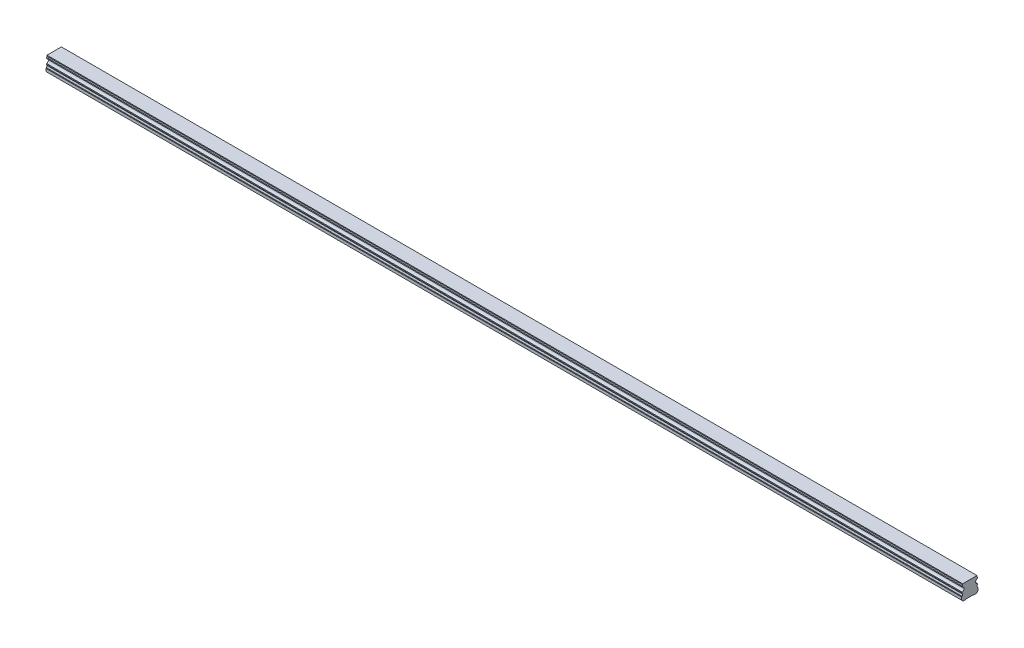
ISO-10303-21;
HEADER;
FILE_DESCRIPTION(('STEP AP214'),'2;1');
FILE_NAME('part.step','',(''),(''),'','','');
FILE_SCHEMA(('AUTOMOTIVE_DESIGN { 1 0 10303 214 1 1 1 1 }'));
ENDSEC;
DATA;
#1=APPLICATION_CONTEXT('core data for automotive mechanical design processes');
#2=APPLICATION_PROTOCOL_DEFINITION('international standard','automotive_design',2000,#1);
#3=PRODUCT_CONTEXT('',#1,'mechanical');
#4=PRODUCT('Part','Part','',(#3));
#5=PRODUCT_RELATED_PRODUCT_CATEGORY('part','',(#4));
#6=PRODUCT_DEFINITION_FORMATION('','',#4);
#7=PRODUCT_DEFINITION_CONTEXT('part definition',#1,'design');
#8=PRODUCT_DEFINITION('design','',#6,#7);
#9=PRODUCT_DEFINITION_SHAPE('','',#8);
#10=(LENGTH_UNIT() NAMED_UNIT(*) SI_UNIT(.MILLI.,.METRE.));
#11=(NAMED_UNIT(*) PLANE_ANGLE_UNIT() SI_UNIT($,.RADIAN.));
#12=(NAMED_UNIT(*) SI_UNIT($,.STERADIAN.) SOLID_ANGLE_UNIT());
#13=UNCERTAINTY_MEASURE_WITH_UNIT(LENGTH_MEASURE(1.E-05),#10,'distance_accuracy_value','');
#14=(GEOMETRIC_REPRESENTATION_CONTEXT(3) GLOBAL_UNCERTAINTY_ASSIGNED_CONTEXT((#13)) GLOBAL_UNIT_ASSIGNED_CONTEXT((#10,
#11,#12)) REPRESENTATION_CONTEXT('',''));
#15=CARTESIAN_POINT('',(0.,0.,0.));
#16=DIRECTION('',(0.,0.,1.));
#17=DIRECTION('',(1.,0.,0.));
#18=AXIS2_PLACEMENT_3D('',#15,#16,#17);
#19=CARTESIAN_POINT('',(810.,0.399999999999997,0.));
#20=DIRECTION('',(0.,-1.,0.));
#21=DIRECTION('',(0.,0.,-1.));
#22=AXIS2_PLACEMENT_3D('',#19,#20,#21);
#23=CONICAL_SURFACE('',#22,2.90000000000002,0.785398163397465);
#24=CARTESIAN_POINT('',(810.,0.799999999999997,0.));
#25=DIRECTION('',(0.,1.,0.));
#26=DIRECTION('',(0.,0.,1.));
#27=AXIS2_PLACEMENT_3D('',#24,#25,#26);
#28=CIRCLE('',#27,2.5);
#29=CARTESIAN_POINT('',(810.,0.799999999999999,2.5));
#30=VERTEX_POINT('',#29);
#31=EDGE_CURVE('E11',#30,#30,#28,.F.);
#32=ORIENTED_EDGE('',*,*,#31,.F.);
#33=EDGE_LOOP('',(#32));
#34=FACE_BOUND('',#33,.T.);
#35=CARTESIAN_POINT('',(810.,0.399999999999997,0.));
#36=DIRECTION('',(0.,1.,0.));
#37=DIRECTION('',(0.,0.,1.));
#38=AXIS2_PLACEMENT_3D('',#35,#36,#37);
#39=CIRCLE('',#38,2.90000000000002);
#40=CARTESIAN_POINT('',(810.,0.399999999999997,2.90000000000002));
#41=VERTEX_POINT('',#40);
#42=EDGE_CURVE('E564',#41,#41,#39,.T.);
#43=ORIENTED_EDGE('',*,*,#42,.F.);
#44=EDGE_LOOP('',(#43));
#45=FACE_BOUND('',#44,.T.);
#46=ADVANCED_FACE('F39',(#34,#45),#23,.F.);
#47=CARTESIAN_POINT('',(810.,7.,0.));
#48=DIRECTION('',(0.,-1.,0.));
#49=DIRECTION('',(0.,0.,-1.));
#50=AXIS2_PLACEMENT_3D('',#47,#48,#49);
#51=CYLINDRICAL_SURFACE('',#50,2.5);
#52=ORIENTED_EDGE('',*,*,#31,.T.);
#53=EDGE_LOOP('',(#52));
#54=FACE_BOUND('',#53,.T.);
#55=CARTESIAN_POINT('',(810.,7.,0.));
#56=DIRECTION('',(0.,-1.,0.));
#57=DIRECTION('',(0.,0.,-1.));
#58=AXIS2_PLACEMENT_3D('',#55,#56,#57);
#59=CIRCLE('',#58,2.5);
#60=CARTESIAN_POINT('',(810.,7.,-2.50000000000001));
#61=VERTEX_POINT('',#60);
#62=EDGE_CURVE('E49',#61,#61,#59,.T.);
#63=ORIENTED_EDGE('',*,*,#62,.F.);
#64=EDGE_LOOP('',(#63));
#65=FACE_BOUND('',#64,.T.);
#66=ADVANCED_FACE('F778',(#54,#65),#51,.F.);
#67=CARTESIAN_POINT('',(810.,7.,0.));
#68=DIRECTION('',(0.,-1.,0.));
#69=DIRECTION('',(0.,0.,-1.));
#70=AXIS2_PLACEMENT_3D('',#67,#68,#69);
#71=PLANE('',#70);
#72=CARTESIAN_POINT('',(810.,7.,0.));
#73=DIRECTION('',(0.,-1.,0.));
#74=DIRECTION('',(0.,0.,-1.));
#75=AXIS2_PLACEMENT_3D('',#72,#73,#74);
#76=CIRCLE('',#75,2.1);
#77=CARTESIAN_POINT('',(810.,7.,-2.1));
#78=VERTEX_POINT('',#77);
#79=EDGE_CURVE('E42',#78,#78,#76,.T.);
#80=ORIENTED_EDGE('',*,*,#79,.F.);
#81=EDGE_LOOP('',(#80));
#82=FACE_BOUND('',#81,.T.);
#83=ORIENTED_EDGE('',*,*,#62,.T.);
#84=EDGE_LOOP('',(#83));
#85=FACE_BOUND('',#84,.T.);
#86=ADVANCED_FACE('F783',(#82,#85),#71,.T.);
#87=CARTESIAN_POINT('',(750.,0.399999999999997,0.));
#88=DIRECTION('',(0.,-1.,0.));
#89=DIRECTION('',(0.,0.,-1.));
#90=AXIS2_PLACEMENT_3D('',#87,#88,#89);
#91=CONICAL_SURFACE('',#90,2.90000000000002,0.785398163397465);
#92=CARTESIAN_POINT('',(750.,0.799999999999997,0.));
#93=DIRECTION('',(0.,1.,0.));
#94=DIRECTION('',(0.,0.,1.));
#95=AXIS2_PLACEMENT_3D('',#92,#93,#94);
#96=CIRCLE('',#95,2.5);
#97=CARTESIAN_POINT('',(750.,0.799999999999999,2.5));
#98=VERTEX_POINT('',#97);
#99=EDGE_CURVE('E560',#98,#98,#96,.F.);
#100=ORIENTED_EDGE('',*,*,#99,.F.);
#101=EDGE_LOOP('',(#100));
#102=FACE_BOUND('',#101,.T.);
#103=CARTESIAN_POINT('',(750.,0.399999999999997,0.));
#104=DIRECTION('',(0.,1.,0.));
#105=DIRECTION('',(0.,0.,1.));
#106=AXIS2_PLACEMENT_3D('',#103,#104,#105);
#107=CIRCLE('',#106,2.90000000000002);
#108=CARTESIAN_POINT('',(750.,0.399999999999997,2.90000000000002));
#109=VERTEX_POINT('',#108);
#110=EDGE_CURVE('E552',#109,#109,#107,.T.);
#111=ORIENTED_EDGE('',*,*,#110,.F.);
#112=EDGE_LOOP('',(#111));
#113=FACE_BOUND('',#112,.T.);
#114=ADVANCED_FACE('F990',(#102,#113),#91,.F.);
#115=CARTESIAN_POINT('',(750.,7.,0.));
#116=DIRECTION('',(0.,-1.,0.));
#117=DIRECTION('',(0.,0.,-1.));
#118=AXIS2_PLACEMENT_3D('',#115,#116,#117);
#119=CYLINDRICAL_SURFACE('',#118,2.5);
#120=ORIENTED_EDGE('',*,*,#99,.T.);
#121=EDGE_LOOP('',(#120));
#122=FACE_BOUND('',#121,.T.);
#123=CARTESIAN_POINT('',(750.,7.,0.));
#124=DIRECTION('',(0.,-1.,0.));
#125=DIRECTION('',(0.,0.,-1.));
#126=AXIS2_PLACEMENT_3D('',#123,#124,#125);
#127=CIRCLE('',#126,2.5);
#128=CARTESIAN_POINT('',(750.,7.,-2.50000000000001));
#129=VERTEX_POINT('',#128);
#130=EDGE_CURVE('E556',#129,#129,#127,.T.);
#131=ORIENTED_EDGE('',*,*,#130,.F.);
#132=EDGE_LOOP('',(#131));
#133=FACE_BOUND('',#132,.T.);
#134=ADVANCED_FACE('F986',(#122,#133),#119,.F.);
#135=CARTESIAN_POINT('',(750.,7.,0.));
#136=DIRECTION('',(0.,-1.,0.));
#137=DIRECTION('',(0.,0.,-1.));
#138=AXIS2_PLACEMENT_3D('',#135,#136,#137);
#139=PLANE('',#138);
#140=CARTESIAN_POINT('',(750.,7.,0.));
#141=DIRECTION('',(0.,-1.,0.));
#142=DIRECTION('',(0.,0.,-1.));
#143=AXIS2_PLACEMENT_3D('',#140,#141,#142);
#144=CIRCLE('',#143,2.1);
#145=CARTESIAN_POINT('',(750.,7.,-2.1));
#146=VERTEX_POINT('',#145);
#147=EDGE_CURVE('E615',#146,#146,#144,.T.);
#148=ORIENTED_EDGE('',*,*,#147,.F.);
#149=EDGE_LOOP('',(#148));
#150=FACE_BOUND('',#149,.T.);
#151=ORIENTED_EDGE('',*,*,#130,.T.);
#152=EDGE_LOOP('',(#151));
#153=FACE_BOUND('',#152,.T.);
#154=ADVANCED_FACE('F982',(#150,#153),#139,.T.);
#155=CARTESIAN_POINT('',(690.,0.399999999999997,0.));
#156=DIRECTION('',(0.,-1.,0.));
#157=DIRECTION('',(0.,0.,-1.));
#158=AXIS2_PLACEMENT_3D('',#155,#156,#157);
#159=CONICAL_SURFACE('',#158,2.90000000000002,0.785398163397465);
#160=CARTESIAN_POINT('',(690.,0.799999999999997,0.));
#161=DIRECTION('',(0.,1.,0.));
#162=DIRECTION('',(0.,0.,1.));
#163=AXIS2_PLACEMENT_3D('',#160,#161,#162);
#164=CIRCLE('',#163,2.5);
#165=CARTESIAN_POINT('',(690.,0.799999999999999,2.5));
#166=VERTEX_POINT('',#165);
#167=EDGE_CURVE('E548',#166,#166,#164,.F.);
#168=ORIENTED_EDGE('',*,*,#167,.F.);
#169=EDGE_LOOP('',(#168));
#170=FACE_BOUND('',#169,.T.);
#171=CARTESIAN_POINT('',(690.,0.399999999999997,0.));
#172=DIRECTION('',(0.,1.,0.));
#173=DIRECTION('',(0.,0.,1.));
#174=AXIS2_PLACEMENT_3D('',#171,#172,#173);
#175=CIRCLE('',#174,2.90000000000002);
#176=CARTESIAN_POINT('',(690.,0.399999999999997,2.90000000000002));
#177=VERTEX_POINT('',#176);
#178=EDGE_CURVE('E540',#177,#177,#175,.T.);
#179=ORIENTED_EDGE('',*,*,#178,.F.);
#180=EDGE_LOOP('',(#179));
#181=FACE_BOUND('',#180,.T.);
#182=ADVANCED_FACE('F978',(#170,#181),#159,.F.);
#183=CARTESIAN_POINT('',(690.,7.,0.));
#184=DIRECTION('',(0.,-1.,0.));
#185=DIRECTION('',(0.,0.,-1.));
#186=AXIS2_PLACEMENT_3D('',#183,#184,#185);
#187=CYLINDRICAL_SURFACE('',#186,2.5);
#188=ORIENTED_EDGE('',*,*,#167,.T.);
#189=EDGE_LOOP('',(#188));
#190=FACE_BOUND('',#189,.T.);
#191=CARTESIAN_POINT('',(690.,7.,0.));
#192=DIRECTION('',(0.,-1.,0.));
#193=DIRECTION('',(0.,0.,-1.));
#194=AXIS2_PLACEMENT_3D('',#191,#192,#193);
#195=CIRCLE('',#194,2.5);
#196=CARTESIAN_POINT('',(690.,7.,-2.50000000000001));
#197=VERTEX_POINT('',#196);
#198=EDGE_CURVE('E544',#197,#197,#195,.T.);
#199=ORIENTED_EDGE('',*,*,#198,.F.);
#200=EDGE_LOOP('',(#199));
#201=FACE_BOUND('',#200,.T.);
#202=ADVANCED_FACE('F974',(#190,#201),#187,.F.);
#203=CARTESIAN_POINT('',(690.,7.,0.));
#204=DIRECTION('',(0.,-1.,0.));
#205=DIRECTION('',(0.,0.,-1.));
#206=AXIS2_PLACEMENT_3D('',#203,#204,#205);
#207=PLANE('',#206);
#208=CARTESIAN_POINT('',(690.,7.,0.));
#209=DIRECTION('',(0.,-1.,0.));
#210=DIRECTION('',(0.,0.,-1.));
#211=AXIS2_PLACEMENT_3D('',#208,#209,#210);
#212=CIRCLE('',#211,2.1);
#213=CARTESIAN_POINT('',(690.,7.,-2.1));
#214=VERTEX_POINT('',#213);
#215=EDGE_CURVE('E612',#214,#214,#212,.T.);
#216=ORIENTED_EDGE('',*,*,#215,.F.);
#217=EDGE_LOOP('',(#216));
#218=FACE_BOUND('',#217,.T.);
#219=ORIENTED_EDGE('',*,*,#198,.T.);
#220=EDGE_LOOP('',(#219));
#221=FACE_BOUND('',#220,.T.);
#222=ADVANCED_FACE('F970',(#218,#221),#207,.T.);
#223=CARTESIAN_POINT('',(630.,0.399999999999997,0.));
#224=DIRECTION('',(0.,-1.,0.));
#225=DIRECTION('',(0.,0.,-1.));
#226=AXIS2_PLACEMENT_3D('',#223,#224,#225);
#227=CONICAL_SURFACE('',#226,2.90000000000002,0.785398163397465);
#228=CARTESIAN_POINT('',(630.,0.799999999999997,0.));
#229=DIRECTION('',(0.,1.,0.));
#230=DIRECTION('',(0.,0.,1.));
#231=AXIS2_PLACEMENT_3D('',#228,#229,#230);
#232=CIRCLE('',#231,2.5);
#233=CARTESIAN_POINT('',(630.,0.799999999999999,2.5));
#234=VERTEX_POINT('',#233);
#235=EDGE_CURVE('E536',#234,#234,#232,.F.);
#236=ORIENTED_EDGE('',*,*,#235,.F.);
#237=EDGE_LOOP('',(#236));
#238=FACE_BOUND('',#237,.T.);
#239=CARTESIAN_POINT('',(630.,0.399999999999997,0.));
#240=DIRECTION('',(0.,1.,0.));
#241=DIRECTION('',(0.,0.,1.));
#242=AXIS2_PLACEMENT_3D('',#239,#240,#241);
#243=CIRCLE('',#242,2.90000000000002);
#244=CARTESIAN_POINT('',(630.,0.399999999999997,2.90000000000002));
#245=VERTEX_POINT('',#244);
#246=EDGE_CURVE('E528',#245,#245,#243,.T.);
#247=ORIENTED_EDGE('',*,*,#246,.F.);
#248=EDGE_LOOP('',(#247));
#249=FACE_BOUND('',#248,.T.);
#250=ADVANCED_FACE('F966',(#238,#249),#227,.F.);
#251=CARTESIAN_POINT('',(630.,7.,0.));
#252=DIRECTION('',(0.,-1.,0.));
#253=DIRECTION('',(0.,0.,-1.));
#254=AXIS2_PLACEMENT_3D('',#251,#252,#253);
#255=CYLINDRICAL_SURFACE('',#254,2.5);
#256=ORIENTED_EDGE('',*,*,#235,.T.);
#257=EDGE_LOOP('',(#256));
#258=FACE_BOUND('',#257,.T.);
#259=CARTESIAN_POINT('',(630.,7.,0.));
#260=DIRECTION('',(0.,-1.,0.));
#261=DIRECTION('',(0.,0.,-1.));
#262=AXIS2_PLACEMENT_3D('',#259,#260,#261);
#263=CIRCLE('',#262,2.5);
#264=CARTESIAN_POINT('',(630.,7.,-2.50000000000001));
#265=VERTEX_POINT('',#264);
#266=EDGE_CURVE('E532',#265,#265,#263,.T.);
#267=ORIENTED_EDGE('',*,*,#266,.F.);
#268=EDGE_LOOP('',(#267));
#269=FACE_BOUND('',#268,.T.);
#270=ADVANCED_FACE('F962',(#258,#269),#255,.F.);
#271=CARTESIAN_POINT('',(630.,7.,0.));
#272=DIRECTION('',(0.,-1.,0.));
#273=DIRECTION('',(0.,0.,-1.));
#274=AXIS2_PLACEMENT_3D('',#271,#272,#273);
#275=PLANE('',#274);
#276=CARTESIAN_POINT('',(630.,7.,0.));
#277=DIRECTION('',(0.,-1.,0.));
#278=DIRECTION('',(0.,0.,-1.));
#279=AXIS2_PLACEMENT_3D('',#276,#277,#278);
#280=CIRCLE('',#279,2.1);
#281=CARTESIAN_POINT('',(630.,7.,-2.1));
#282=VERTEX_POINT('',#281);
#283=EDGE_CURVE('E608',#282,#282,#280,.T.);
#284=ORIENTED_EDGE('',*,*,#283,.F.);
#285=EDGE_LOOP('',(#284));
#286=FACE_BOUND('',#285,.T.);
#287=ORIENTED_EDGE('',*,*,#266,.T.);
#288=EDGE_LOOP('',(#287));
#289=FACE_BOUND('',#288,.T.);
#290=ADVANCED_FACE('F958',(#286,#289),#275,.T.);
#291=CARTESIAN_POINT('',(570.,0.399999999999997,0.));
#292=DIRECTION('',(0.,-1.,0.));
#293=DIRECTION('',(0.,0.,-1.));
#294=AXIS2_PLACEMENT_3D('',#291,#292,#293);
#295=CONICAL_SURFACE('',#294,2.90000000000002,0.785398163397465);
#296=CARTESIAN_POINT('',(570.,0.799999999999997,0.));
#297=DIRECTION('',(0.,1.,0.));
#298=DIRECTION('',(0.,0.,1.));
#299=AXIS2_PLACEMENT_3D('',#296,#297,#298);
#300=CIRCLE('',#299,2.5);
#301=CARTESIAN_POINT('',(570.,0.799999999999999,2.5));
#302=VERTEX_POINT('',#301);
#303=EDGE_CURVE('E524',#302,#302,#300,.F.);
#304=ORIENTED_EDGE('',*,*,#303,.F.);
#305=EDGE_LOOP('',(#304));
#306=FACE_BOUND('',#305,.T.);
#307=CARTESIAN_POINT('',(570.,0.399999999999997,0.));
#308=DIRECTION('',(0.,1.,0.));
#309=DIRECTION('',(0.,0.,1.));
#310=AXIS2_PLACEMENT_3D('',#307,#308,#309);
#311=CIRCLE('',#310,2.90000000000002);
#312=CARTESIAN_POINT('',(570.,0.399999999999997,2.90000000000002));
#313=VERTEX_POINT('',#312);
#314=EDGE_CURVE('E516',#313,#313,#311,.T.);
#315=ORIENTED_EDGE('',*,*,#314,.F.);
#316=EDGE_LOOP('',(#315));
#317=FACE_BOUND('',#316,.T.);
#318=ADVANCED_FACE('F954',(#306,#317),#295,.F.);
#319=CARTESIAN_POINT('',(570.,7.,0.));
#320=DIRECTION('',(0.,-1.,0.));
#321=DIRECTION('',(0.,0.,-1.));
#322=AXIS2_PLACEMENT_3D('',#319,#320,#321);
#323=CYLINDRICAL_SURFACE('',#322,2.5);
#324=ORIENTED_EDGE('',*,*,#303,.T.);
#325=EDGE_LOOP('',(#324));
#326=FACE_BOUND('',#325,.T.);
#327=CARTESIAN_POINT('',(570.,7.,0.));
#328=DIRECTION('',(0.,-1.,0.));
#329=DIRECTION('',(0.,0.,-1.));
#330=AXIS2_PLACEMENT_3D('',#327,#328,#329);
#331=CIRCLE('',#330,2.5);
#332=CARTESIAN_POINT('',(570.,7.,-2.50000000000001));
#333=VERTEX_POINT('',#332);
#334=EDGE_CURVE('E520',#333,#333,#331,.T.);
#335=ORIENTED_EDGE('',*,*,#334,.F.);
#336=EDGE_LOOP('',(#335));
#337=FACE_BOUND('',#336,.T.);
#338=ADVANCED_FACE('F950',(#326,#337),#323,.F.);
#339=CARTESIAN_POINT('',(570.,7.,0.));
#340=DIRECTION('',(0.,-1.,0.));
#341=DIRECTION('',(0.,0.,-1.));
#342=AXIS2_PLACEMENT_3D('',#339,#340,#341);
#343=PLANE('',#342);
#344=CARTESIAN_POINT('',(570.,7.,0.));
#345=DIRECTION('',(0.,-1.,0.));
#346=DIRECTION('',(0.,0.,-1.));
#347=AXIS2_PLACEMENT_3D('',#344,#345,#346);
#348=CIRCLE('',#347,2.1);
#349=CARTESIAN_POINT('',(570.,7.,-2.1));
#350=VERTEX_POINT('',#349);
#351=EDGE_CURVE('E604',#350,#350,#348,.T.);
#352=ORIENTED_EDGE('',*,*,#351,.F.);
#353=EDGE_LOOP('',(#352));
#354=FACE_BOUND('',#353,.T.);
#355=ORIENTED_EDGE('',*,*,#334,.T.);
#356=EDGE_LOOP('',(#355));
#357=FACE_BOUND('',#356,.T.);
#358=ADVANCED_FACE('F946',(#354,#357),#343,.T.);
#359=CARTESIAN_POINT('',(510.,0.399999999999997,0.));
#360=DIRECTION('',(0.,-1.,0.));
#361=DIRECTION('',(0.,0.,-1.));
#362=AXIS2_PLACEMENT_3D('',#359,#360,#361);
#363=CONICAL_SURFACE('',#362,2.90000000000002,0.785398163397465);
#364=CARTESIAN_POINT('',(510.,0.799999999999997,0.));
#365=DIRECTION('',(0.,1.,0.));
#366=DIRECTION('',(0.,0.,1.));
#367=AXIS2_PLACEMENT_3D('',#364,#365,#366);
#368=CIRCLE('',#367,2.5);
#369=CARTESIAN_POINT('',(510.,0.799999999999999,2.5));
#370=VERTEX_POINT('',#369);
#371=EDGE_CURVE('E512',#370,#370,#368,.F.);
#372=ORIENTED_EDGE('',*,*,#371,.F.);
#373=EDGE_LOOP('',(#372));
#374=FACE_BOUND('',#373,.T.);
#375=CARTESIAN_POINT('',(510.,0.399999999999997,0.));
#376=DIRECTION('',(0.,1.,0.));
#377=DIRECTION('',(0.,0.,1.));
#378=AXIS2_PLACEMENT_3D('',#375,#376,#377);
#379=CIRCLE('',#378,2.90000000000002);
#380=CARTESIAN_POINT('',(510.,0.399999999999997,2.90000000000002));
#381=VERTEX_POINT('',#380);
#382=EDGE_CURVE('E505',#381,#381,#379,.T.);
#383=ORIENTED_EDGE('',*,*,#382,.F.);
#384=EDGE_LOOP('',(#383));
#385=FACE_BOUND('',#384,.T.);
#386=ADVANCED_FACE('F942',(#374,#385),#363,.F.);
#387=CARTESIAN_POINT('',(510.,7.,0.));
#388=DIRECTION('',(0.,-1.,0.));
#389=DIRECTION('',(0.,0.,-1.));
#390=AXIS2_PLACEMENT_3D('',#387,#388,#389);
#391=CYLINDRICAL_SURFACE('',#390,2.5);
#392=ORIENTED_EDGE('',*,*,#371,.T.);
#393=EDGE_LOOP('',(#392));
#394=FACE_BOUND('',#393,.T.);
#395=CARTESIAN_POINT('',(510.,7.,0.));
#396=DIRECTION('',(0.,-1.,0.));
#397=DIRECTION('',(0.,0.,-1.));
#398=AXIS2_PLACEMENT_3D('',#395,#396,#397);
#399=CIRCLE('',#398,2.5);
#400=CARTESIAN_POINT('',(510.,7.,-2.50000000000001));
#401=VERTEX_POINT('',#400);
#402=EDGE_CURVE('E508',#401,#401,#399,.T.);
#403=ORIENTED_EDGE('',*,*,#402,.F.);
#404=EDGE_LOOP('',(#403));
#405=FACE_BOUND('',#404,.T.);
#406=ADVANCED_FACE('F938',(#394,#405),#391,.F.);
#407=CARTESIAN_POINT('',(510.,7.,0.));
#408=DIRECTION('',(0.,-1.,0.));
#409=DIRECTION('',(0.,0.,-1.));
#410=AXIS2_PLACEMENT_3D('',#407,#408,#409);
#411=PLANE('',#410);
#412=CARTESIAN_POINT('',(510.,7.,0.));
#413=DIRECTION('',(0.,-1.,0.));
#414=DIRECTION('',(0.,0.,-1.));
#415=AXIS2_PLACEMENT_3D('',#412,#413,#414);
#416=CIRCLE('',#415,2.1);
#417=CARTESIAN_POINT('',(510.,7.,-2.1));
#418=VERTEX_POINT('',#417);
#419=EDGE_CURVE('E600',#418,#418,#416,.T.);
#420=ORIENTED_EDGE('',*,*,#419,.F.);
#421=EDGE_LOOP('',(#420));
#422=FACE_BOUND('',#421,.T.);
#423=ORIENTED_EDGE('',*,*,#402,.T.);
#424=EDGE_LOOP('',(#423));
#425=FACE_BOUND('',#424,.T.);
#426=ADVANCED_FACE('F934',(#422,#425),#411,.T.);
#427=CARTESIAN_POINT('',(450.,0.399999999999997,0.));
#428=DIRECTION('',(0.,-1.,0.));
#429=DIRECTION('',(0.,0.,-1.));
#430=AXIS2_PLACEMENT_3D('',#427,#428,#429);
#431=CONICAL_SURFACE('',#430,2.90000000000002,0.785398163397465);
#432=CARTESIAN_POINT('',(450.,0.799999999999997,0.));
#433=DIRECTION('',(0.,1.,0.));
#434=DIRECTION('',(0.,0.,1.));
#435=AXIS2_PLACEMENT_3D('',#432,#433,#434);
#436=CIRCLE('',#435,2.5);
#437=CARTESIAN_POINT('',(450.,0.799999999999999,2.5));
#438=VERTEX_POINT('',#437);
#439=EDGE_CURVE('E501',#438,#438,#436,.F.);
#440=ORIENTED_EDGE('',*,*,#439,.F.);
#441=EDGE_LOOP('',(#440));
#442=FACE_BOUND('',#441,.T.);
#443=CARTESIAN_POINT('',(450.,0.399999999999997,0.));
#444=DIRECTION('',(0.,1.,0.));
#445=DIRECTION('',(0.,0.,1.));
#446=AXIS2_PLACEMENT_3D('',#443,#444,#445);
#447=CIRCLE('',#446,2.90000000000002);
#448=CARTESIAN_POINT('',(450.,0.399999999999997,2.90000000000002));
#449=VERTEX_POINT('',#448);
#450=EDGE_CURVE('E493',#449,#449,#447,.T.);
#451=ORIENTED_EDGE('',*,*,#450,.F.);
#452=EDGE_LOOP('',(#451));
#453=FACE_BOUND('',#452,.T.);
#454=ADVANCED_FACE('F930',(#442,#453),#431,.F.);
#455=CARTESIAN_POINT('',(450.,7.,0.));
#456=DIRECTION('',(0.,-1.,0.));
#457=DIRECTION('',(0.,0.,-1.));
#458=AXIS2_PLACEMENT_3D('',#455,#456,#457);
#459=CYLINDRICAL_SURFACE('',#458,2.5);
#460=ORIENTED_EDGE('',*,*,#439,.T.);
#461=EDGE_LOOP('',(#460));
#462=FACE_BOUND('',#461,.T.);
#463=CARTESIAN_POINT('',(450.,7.,0.));
#464=DIRECTION('',(0.,-1.,0.));
#465=DIRECTION('',(0.,0.,-1.));
#466=AXIS2_PLACEMENT_3D('',#463,#464,#465);
#467=CIRCLE('',#466,2.5);
#468=CARTESIAN_POINT('',(450.,7.,-2.50000000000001));
#469=VERTEX_POINT('',#468);
#470=EDGE_CURVE('E497',#469,#469,#467,.T.);
#471=ORIENTED_EDGE('',*,*,#470,.F.);
#472=EDGE_LOOP('',(#471));
#473=FACE_BOUND('',#472,.T.);
#474=ADVANCED_FACE('F926',(#462,#473),#459,.F.);
#475=CARTESIAN_POINT('',(450.,7.,0.));
#476=DIRECTION('',(0.,-1.,0.));
#477=DIRECTION('',(0.,0.,-1.));
#478=AXIS2_PLACEMENT_3D('',#475,#476,#477);
#479=PLANE('',#478);
#480=CARTESIAN_POINT('',(450.,7.,0.));
#481=DIRECTION('',(0.,-1.,0.));
#482=DIRECTION('',(0.,0.,-1.));
#483=AXIS2_PLACEMENT_3D('',#480,#481,#482);
#484=CIRCLE('',#483,2.1);
#485=CARTESIAN_POINT('',(450.,7.,-2.1));
#486=VERTEX_POINT('',#485);
#487=EDGE_CURVE('E596',#486,#486,#484,.T.);
#488=ORIENTED_EDGE('',*,*,#487,.F.);
#489=EDGE_LOOP('',(#488));
#490=FACE_BOUND('',#489,.T.);
#491=ORIENTED_EDGE('',*,*,#470,.T.);
#492=EDGE_LOOP('',(#491));
#493=FACE_BOUND('',#492,.T.);
#494=ADVANCED_FACE('F922',(#490,#493),#479,.T.);
#495=CARTESIAN_POINT('',(390.,0.399999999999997,0.));
#496=DIRECTION('',(0.,-1.,0.));
#497=DIRECTION('',(0.,0.,-1.));
#498=AXIS2_PLACEMENT_3D('',#495,#496,#497);
#499=CONICAL_SURFACE('',#498,2.90000000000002,0.785398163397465);
#500=CARTESIAN_POINT('',(390.,0.799999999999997,0.));
#501=DIRECTION('',(0.,1.,0.));
#502=DIRECTION('',(0.,0.,1.));
#503=AXIS2_PLACEMENT_3D('',#500,#501,#502);
#504=CIRCLE('',#503,2.5);
#505=CARTESIAN_POINT('',(390.,0.799999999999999,2.5));
#506=VERTEX_POINT('',#505);
#507=EDGE_CURVE('E489',#506,#506,#504,.F.);
#508=ORIENTED_EDGE('',*,*,#507,.F.);
#509=EDGE_LOOP('',(#508));
#510=FACE_BOUND('',#509,.T.);
#511=CARTESIAN_POINT('',(390.,0.399999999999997,0.));
#512=DIRECTION('',(0.,1.,0.));
#513=DIRECTION('',(0.,0.,1.));
#514=AXIS2_PLACEMENT_3D('',#511,#512,#513);
#515=CIRCLE('',#514,2.90000000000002);
#516=CARTESIAN_POINT('',(390.,0.399999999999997,2.90000000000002));
#517=VERTEX_POINT('',#516);
#518=EDGE_CURVE('E481',#517,#517,#515,.T.);
#519=ORIENTED_EDGE('',*,*,#518,.F.);
#520=EDGE_LOOP('',(#519));
#521=FACE_BOUND('',#520,.T.);
#522=ADVANCED_FACE('F918',(#510,#521),#499,.F.);
#523=CARTESIAN_POINT('',(390.,7.,0.));
#524=DIRECTION('',(0.,-1.,0.));
#525=DIRECTION('',(0.,0.,-1.));
#526=AXIS2_PLACEMENT_3D('',#523,#524,#525);
#527=CYLINDRICAL_SURFACE('',#526,2.5);
#528=ORIENTED_EDGE('',*,*,#507,.T.);
#529=EDGE_LOOP('',(#528));
#530=FACE_BOUND('',#529,.T.);
#531=CARTESIAN_POINT('',(390.,7.,0.));
#532=DIRECTION('',(0.,-1.,0.));
#533=DIRECTION('',(0.,0.,-1.));
#534=AXIS2_PLACEMENT_3D('',#531,#532,#533);
#535=CIRCLE('',#534,2.5);
#536=CARTESIAN_POINT('',(390.,7.,-2.50000000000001));
#537=VERTEX_POINT('',#536);
#538=EDGE_CURVE('E485',#537,#537,#535,.T.);
#539=ORIENTED_EDGE('',*,*,#538,.F.);
#540=EDGE_LOOP('',(#539));
#541=FACE_BOUND('',#540,.T.);
#542=ADVANCED_FACE('F914',(#530,#541),#527,.F.);
#543=CARTESIAN_POINT('',(390.,7.,0.));
#544=DIRECTION('',(0.,-1.,0.));
#545=DIRECTION('',(0.,0.,-1.));
#546=AXIS2_PLACEMENT_3D('',#543,#544,#545);
#547=PLANE('',#546);
#548=CARTESIAN_POINT('',(390.,7.,0.));
#549=DIRECTION('',(0.,-1.,0.));
#550=DIRECTION('',(0.,0.,-1.));
#551=AXIS2_PLACEMENT_3D('',#548,#549,#550);
#552=CIRCLE('',#551,2.1);
#553=CARTESIAN_POINT('',(390.,7.,-2.1));
#554=VERTEX_POINT('',#553);
#555=EDGE_CURVE('E592',#554,#554,#552,.T.);
#556=ORIENTED_EDGE('',*,*,#555,.F.);
#557=EDGE_LOOP('',(#556));
#558=FACE_BOUND('',#557,.T.);
#559=ORIENTED_EDGE('',*,*,#538,.T.);
#560=EDGE_LOOP('',(#559));
#561=FACE_BOUND('',#560,.T.);
#562=ADVANCED_FACE('F910',(#558,#561),#547,.T.);
#563=CARTESIAN_POINT('',(330.,0.399999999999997,0.));
#564=DIRECTION('',(0.,-1.,0.));
#565=DIRECTION('',(0.,0.,-1.));
#566=AXIS2_PLACEMENT_3D('',#563,#564,#565);
#567=CONICAL_SURFACE('',#566,2.90000000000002,0.785398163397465);
#568=CARTESIAN_POINT('',(330.,0.799999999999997,0.));
#569=DIRECTION('',(0.,1.,0.));
#570=DIRECTION('',(0.,0.,1.));
#571=AXIS2_PLACEMENT_3D('',#568,#569,#570);
#572=CIRCLE('',#571,2.5);
#573=CARTESIAN_POINT('',(330.,0.799999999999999,2.5));
#574=VERTEX_POINT('',#573);
#575=EDGE_CURVE('E477',#574,#574,#572,.F.);
#576=ORIENTED_EDGE('',*,*,#575,.F.);
#577=EDGE_LOOP('',(#576));
#578=FACE_BOUND('',#577,.T.);
#579=CARTESIAN_POINT('',(330.,0.399999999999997,0.));
#580=DIRECTION('',(0.,1.,0.));
#581=DIRECTION('',(0.,0.,1.));
#582=AXIS2_PLACEMENT_3D('',#579,#580,#581);
#583=CIRCLE('',#582,2.90000000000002);
#584=CARTESIAN_POINT('',(330.,0.399999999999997,2.90000000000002));
#585=VERTEX_POINT('',#584);
#586=EDGE_CURVE('E469',#585,#585,#583,.T.);
#587=ORIENTED_EDGE('',*,*,#586,.F.);
#588=EDGE_LOOP('',(#587));
#589=FACE_BOUND('',#588,.T.);
#590=ADVANCED_FACE('F906',(#578,#589),#567,.F.);
#591=CARTESIAN_POINT('',(330.,7.,0.));
#592=DIRECTION('',(0.,-1.,0.));
#593=DIRECTION('',(0.,0.,-1.));
#594=AXIS2_PLACEMENT_3D('',#591,#592,#593);
#595=CYLINDRICAL_SURFACE('',#594,2.5);
#596=ORIENTED_EDGE('',*,*,#575,.T.);
#597=EDGE_LOOP('',(#596));
#598=FACE_BOUND('',#597,.T.);
#599=CARTESIAN_POINT('',(330.,7.,0.));
#600=DIRECTION('',(0.,-1.,0.));
#601=DIRECTION('',(0.,0.,-1.));
#602=AXIS2_PLACEMENT_3D('',#599,#600,#601);
#603=CIRCLE('',#602,2.5);
#604=CARTESIAN_POINT('',(330.,7.,-2.50000000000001));
#605=VERTEX_POINT('',#604);
#606=EDGE_CURVE('E473',#605,#605,#603,.T.);
#607=ORIENTED_EDGE('',*,*,#606,.F.);
#608=EDGE_LOOP('',(#607));
#609=FACE_BOUND('',#608,.T.);
#610=ADVANCED_FACE('F902',(#598,#609),#595,.F.);
#611=CARTESIAN_POINT('',(330.,7.,0.));
#612=DIRECTION('',(0.,-1.,0.));
#613=DIRECTION('',(0.,0.,-1.));
#614=AXIS2_PLACEMENT_3D('',#611,#612,#613);
#615=PLANE('',#614);
#616=CARTESIAN_POINT('',(330.,7.,0.));
#617=DIRECTION('',(0.,-1.,0.));
#618=DIRECTION('',(0.,0.,-1.));
#619=AXIS2_PLACEMENT_3D('',#616,#617,#618);
#620=CIRCLE('',#619,2.1);
#621=CARTESIAN_POINT('',(330.,7.,-2.1));
#622=VERTEX_POINT('',#621);
#623=EDGE_CURVE('E588',#622,#622,#620,.T.);
#624=ORIENTED_EDGE('',*,*,#623,.F.);
#625=EDGE_LOOP('',(#624));
#626=FACE_BOUND('',#625,.T.);
#627=ORIENTED_EDGE('',*,*,#606,.T.);
#628=EDGE_LOOP('',(#627));
#629=FACE_BOUND('',#628,.T.);
#630=ADVANCED_FACE('F898',(#626,#629),#615,.T.);
#631=CARTESIAN_POINT('',(270.,0.399999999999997,0.));
#632=DIRECTION('',(0.,-1.,0.));
#633=DIRECTION('',(0.,0.,-1.));
#634=AXIS2_PLACEMENT_3D('',#631,#632,#633);
#635=CONICAL_SURFACE('',#634,2.90000000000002,0.785398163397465);
#636=CARTESIAN_POINT('',(270.,0.799999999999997,0.));
#637=DIRECTION('',(0.,1.,0.));
#638=DIRECTION('',(0.,0.,1.));
#639=AXIS2_PLACEMENT_3D('',#636,#637,#638);
#640=CIRCLE('',#639,2.5);
#641=CARTESIAN_POINT('',(270.,0.799999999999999,2.5));
#642=VERTEX_POINT('',#641);
#643=EDGE_CURVE('E465',#642,#642,#640,.F.);
#644=ORIENTED_EDGE('',*,*,#643,.F.);
#645=EDGE_LOOP('',(#644));
#646=FACE_BOUND('',#645,.T.);
#647=CARTESIAN_POINT('',(270.,0.399999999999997,0.));
#648=DIRECTION('',(0.,1.,0.));
#649=DIRECTION('',(0.,0.,1.));
#650=AXIS2_PLACEMENT_3D('',#647,#648,#649);
#651=CIRCLE('',#650,2.90000000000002);
#652=CARTESIAN_POINT('',(270.,0.399999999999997,2.90000000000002));
#653=VERTEX_POINT('',#652);
#654=EDGE_CURVE('E457',#653,#653,#651,.T.);
#655=ORIENTED_EDGE('',*,*,#654,.F.);
#656=EDGE_LOOP('',(#655));
#657=FACE_BOUND('',#656,.T.);
#658=ADVANCED_FACE('F894',(#646,#657),#635,.F.);
#659=CARTESIAN_POINT('',(270.,7.,0.));
#660=DIRECTION('',(0.,-1.,0.));
#661=DIRECTION('',(0.,0.,-1.));
#662=AXIS2_PLACEMENT_3D('',#659,#660,#661);
#663=CYLINDRICAL_SURFACE('',#662,2.5);
#664=ORIENTED_EDGE('',*,*,#643,.T.);
#665=EDGE_LOOP('',(#664));
#666=FACE_BOUND('',#665,.T.);
#667=CARTESIAN_POINT('',(270.,7.,0.));
#668=DIRECTION('',(0.,-1.,0.));
#669=DIRECTION('',(0.,0.,-1.));
#670=AXIS2_PLACEMENT_3D('',#667,#668,#669);
#671=CIRCLE('',#670,2.5);
#672=CARTESIAN_POINT('',(270.,7.,-2.50000000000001));
#673=VERTEX_POINT('',#672);
#674=EDGE_CURVE('E461',#673,#673,#671,.T.);
#675=ORIENTED_EDGE('',*,*,#674,.F.);
#676=EDGE_LOOP('',(#675));
#677=FACE_BOUND('',#676,.T.);
#678=ADVANCED_FACE('F890',(#666,#677),#663,.F.);
#679=CARTESIAN_POINT('',(270.,7.,0.));
#680=DIRECTION('',(0.,-1.,0.));
#681=DIRECTION('',(0.,0.,-1.));
#682=AXIS2_PLACEMENT_3D('',#679,#680,#681);
#683=PLANE('',#682);
#684=CARTESIAN_POINT('',(270.,7.,0.));
#685=DIRECTION('',(0.,-1.,0.));
#686=DIRECTION('',(0.,0.,-1.));
#687=AXIS2_PLACEMENT_3D('',#684,#685,#686);
#688=CIRCLE('',#687,2.1);
#689=CARTESIAN_POINT('',(270.,7.,-2.1));
#690=VERTEX_POINT('',#689);
#691=EDGE_CURVE('E584',#690,#690,#688,.T.);
#692=ORIENTED_EDGE('',*,*,#691,.F.);
#693=EDGE_LOOP('',(#692));
#694=FACE_BOUND('',#693,.T.);
#695=ORIENTED_EDGE('',*,*,#674,.T.);
#696=EDGE_LOOP('',(#695));
#697=FACE_BOUND('',#696,.T.);
#698=ADVANCED_FACE('F886',(#694,#697),#683,.T.);
#699=CARTESIAN_POINT('',(210.,0.399999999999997,0.));
#700=DIRECTION('',(0.,-1.,0.));
#701=DIRECTION('',(0.,0.,-1.));
#702=AXIS2_PLACEMENT_3D('',#699,#700,#701);
#703=CONICAL_SURFACE('',#702,2.90000000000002,0.785398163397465);
#704=CARTESIAN_POINT('',(210.,0.799999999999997,0.));
#705=DIRECTION('',(0.,1.,0.));
#706=DIRECTION('',(0.,0.,1.));
#707=AXIS2_PLACEMENT_3D('',#704,#705,#706);
#708=CIRCLE('',#707,2.5);
#709=CARTESIAN_POINT('',(210.,0.799999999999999,2.5));
#710=VERTEX_POINT('',#709);
#711=EDGE_CURVE('E453',#710,#710,#708,.F.);
#712=ORIENTED_EDGE('',*,*,#711,.F.);
#713=EDGE_LOOP('',(#712));
#714=FACE_BOUND('',#713,.T.);
#715=CARTESIAN_POINT('',(210.,0.399999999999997,0.));
#716=DIRECTION('',(0.,1.,0.));
#717=DIRECTION('',(0.,0.,1.));
#718=AXIS2_PLACEMENT_3D('',#715,#716,#717);
#719=CIRCLE('',#718,2.90000000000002);
#720=CARTESIAN_POINT('',(210.,0.399999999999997,2.90000000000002));
#721=VERTEX_POINT('',#720);
#722=EDGE_CURVE('E445',#721,#721,#719,.T.);
#723=ORIENTED_EDGE('',*,*,#722,.F.);
#724=EDGE_LOOP('',(#723));
#725=FACE_BOUND('',#724,.T.);
#726=ADVANCED_FACE('F882',(#714,#725),#703,.F.);
#727=CARTESIAN_POINT('',(210.,7.,0.));
#728=DIRECTION('',(0.,-1.,0.));
#729=DIRECTION('',(0.,0.,-1.));
#730=AXIS2_PLACEMENT_3D('',#727,#728,#729);
#731=CYLINDRICAL_SURFACE('',#730,2.5);
#732=ORIENTED_EDGE('',*,*,#711,.T.);
#733=EDGE_LOOP('',(#732));
#734=FACE_BOUND('',#733,.T.);
#735=CARTESIAN_POINT('',(210.,7.,0.));
#736=DIRECTION('',(0.,-1.,0.));
#737=DIRECTION('',(0.,0.,-1.));
#738=AXIS2_PLACEMENT_3D('',#735,#736,#737);
#739=CIRCLE('',#738,2.5);
#740=CARTESIAN_POINT('',(210.,7.,-2.50000000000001));
#741=VERTEX_POINT('',#740);
#742=EDGE_CURVE('E449',#741,#741,#739,.T.);
#743=ORIENTED_EDGE('',*,*,#742,.F.);
#744=EDGE_LOOP('',(#743));
#745=FACE_BOUND('',#744,.T.);
#746=ADVANCED_FACE('F878',(#734,#745),#731,.F.);
#747=CARTESIAN_POINT('',(210.,7.,0.));
#748=DIRECTION('',(0.,-1.,0.));
#749=DIRECTION('',(0.,0.,-1.));
#750=AXIS2_PLACEMENT_3D('',#747,#748,#749);
#751=PLANE('',#750);
#752=CARTESIAN_POINT('',(210.,7.,0.));
#753=DIRECTION('',(0.,-1.,0.));
#754=DIRECTION('',(0.,0.,-1.));
#755=AXIS2_PLACEMENT_3D('',#752,#753,#754);
#756=CIRCLE('',#755,2.1);
#757=CARTESIAN_POINT('',(210.,7.,-2.1));
#758=VERTEX_POINT('',#757);
#759=EDGE_CURVE('E580',#758,#758,#756,.T.);
#760=ORIENTED_EDGE('',*,*,#759,.F.);
#761=EDGE_LOOP('',(#760));
#762=FACE_BOUND('',#761,.T.);
#763=ORIENTED_EDGE('',*,*,#742,.T.);
#764=EDGE_LOOP('',(#763));
#765=FACE_BOUND('',#764,.T.);
#766=ADVANCED_FACE('F874',(#762,#765),#751,.T.);
#767=CARTESIAN_POINT('',(150.,0.399999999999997,0.));
#768=DIRECTION('',(0.,-1.,0.));
#769=DIRECTION('',(0.,0.,-1.));
#770=AXIS2_PLACEMENT_3D('',#767,#768,#769);
#771=CONICAL_SURFACE('',#770,2.90000000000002,0.785398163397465);
#772=CARTESIAN_POINT('',(150.,0.799999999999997,0.));
#773=DIRECTION('',(0.,1.,0.));
#774=DIRECTION('',(0.,0.,1.));
#775=AXIS2_PLACEMENT_3D('',#772,#773,#774);
#776=CIRCLE('',#775,2.5);
#777=CARTESIAN_POINT('',(150.,0.799999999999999,2.5));
#778=VERTEX_POINT('',#777);
#779=EDGE_CURVE('E441',#778,#778,#776,.F.);
#780=ORIENTED_EDGE('',*,*,#779,.F.);
#781=EDGE_LOOP('',(#780));
#782=FACE_BOUND('',#781,.T.);
#783=CARTESIAN_POINT('',(150.,0.399999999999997,0.));
#784=DIRECTION('',(0.,1.,0.));
#785=DIRECTION('',(0.,0.,1.));
#786=AXIS2_PLACEMENT_3D('',#783,#784,#785);
#787=CIRCLE('',#786,2.90000000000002);
#788=CARTESIAN_POINT('',(150.,0.399999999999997,2.90000000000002));
#789=VERTEX_POINT('',#788);
#790=EDGE_CURVE('E433',#789,#789,#787,.T.);
#791=ORIENTED_EDGE('',*,*,#790,.F.);
#792=EDGE_LOOP('',(#791));
#793=FACE_BOUND('',#792,.T.);
#794=ADVANCED_FACE('F870',(#782,#793),#771,.F.);
#795=CARTESIAN_POINT('',(150.,7.,0.));
#796=DIRECTION('',(0.,-1.,0.));
#797=DIRECTION('',(0.,0.,-1.));
#798=AXIS2_PLACEMENT_3D('',#795,#796,#797);
#799=CYLINDRICAL_SURFACE('',#798,2.5);
#800=ORIENTED_EDGE('',*,*,#779,.T.);
#801=EDGE_LOOP('',(#800));
#802=FACE_BOUND('',#801,.T.);
#803=CARTESIAN_POINT('',(150.,7.,0.));
#804=DIRECTION('',(0.,-1.,0.));
#805=DIRECTION('',(0.,0.,-1.));
#806=AXIS2_PLACEMENT_3D('',#803,#804,#805);
#807=CIRCLE('',#806,2.5);
#808=CARTESIAN_POINT('',(150.,7.,-2.50000000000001));
#809=VERTEX_POINT('',#808);
#810=EDGE_CURVE('E437',#809,#809,#807,.T.);
#811=ORIENTED_EDGE('',*,*,#810,.F.);
#812=EDGE_LOOP('',(#811));
#813=FACE_BOUND('',#812,.T.);
#814=ADVANCED_FACE('F866',(#802,#813),#799,.F.);
#815=CARTESIAN_POINT('',(150.,7.,0.));
#816=DIRECTION('',(0.,-1.,0.));
#817=DIRECTION('',(0.,0.,-1.));
#818=AXIS2_PLACEMENT_3D('',#815,#816,#817);
#819=PLANE('',#818);
#820=CARTESIAN_POINT('',(150.,7.,0.));
#821=DIRECTION('',(0.,-1.,0.));
#822=DIRECTION('',(0.,0.,-1.));
#823=AXIS2_PLACEMENT_3D('',#820,#821,#822);
#824=CIRCLE('',#823,2.1);
#825=CARTESIAN_POINT('',(150.,7.,-2.1));
#826=VERTEX_POINT('',#825);
#827=EDGE_CURVE('E575',#826,#826,#824,.T.);
#828=ORIENTED_EDGE('',*,*,#827,.F.);
#829=EDGE_LOOP('',(#828));
#830=FACE_BOUND('',#829,.T.);
#831=ORIENTED_EDGE('',*,*,#810,.T.);
#832=EDGE_LOOP('',(#831));
#833=FACE_BOUND('',#832,.T.);
#834=ADVANCED_FACE('F856',(#830,#833),#819,.T.);
#835=CARTESIAN_POINT('',(840.,14.,-6.59000000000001));
#836=DIRECTION('',(0.,0.,1.));
#837=DIRECTION('',(0.,-1.,0.));
#838=AXIS2_PLACEMENT_3D('',#835,#836,#837);
#839=PLANE('',#838);
#840=DIRECTION('',(0.,1.,0.));
#841=VECTOR('',#840,1.);
#842=CARTESIAN_POINT('',(0.,14.,-6.59000000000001));
#843=LINE('',#842,#841);
#844=CARTESIAN_POINT('',(0.,13.15,-6.59));
#845=VERTEX_POINT('',#844);
#846=CARTESIAN_POINT('',(0.,14.,-6.59000000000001));
#847=VERTEX_POINT('',#846);
#848=EDGE_CURVE('E255',#845,#847,#843,.T.);
#849=ORIENTED_EDGE('',*,*,#848,.T.);
#850=DIRECTION('',(-1.,0.,0.));
#851=VECTOR('',#850,1.);
#852=CARTESIAN_POINT('',(840.,14.,-6.59000000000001));
#853=LINE('',#852,#851);
#854=CARTESIAN_POINT('',(840.,14.,-6.59000000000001));
#855=VERTEX_POINT('',#854);
#856=EDGE_CURVE('E422',#855,#847,#853,.T.);
#857=ORIENTED_EDGE('',*,*,#856,.F.);
#858=DIRECTION('',(0.,1.,0.));
#859=VECTOR('',#858,1.);
#860=CARTESIAN_POINT('',(840.,14.,-6.59000000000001));
#861=LINE('',#860,#859);
#862=CARTESIAN_POINT('',(840.,13.15,-6.59));
#863=VERTEX_POINT('',#862);
#864=EDGE_CURVE('E331',#863,#855,#861,.T.);
#865=ORIENTED_EDGE('',*,*,#864,.F.);
#866=DIRECTION('',(-1.,0.,0.));
#867=VECTOR('',#866,1.);
#868=CARTESIAN_POINT('',(840.,13.15,-6.59));
#869=LINE('',#868,#867);
#870=EDGE_CURVE('E251',#863,#845,#869,.T.);
#871=ORIENTED_EDGE('',*,*,#870,.T.);
#872=EDGE_LOOP('',(#849,#857,#865,#871));
#873=FACE_BOUND('',#872,.T.);
#874=ADVANCED_FACE('F853',(#873),#839,.F.);
#875=CARTESIAN_POINT('',(840.,14.,-6.59000000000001));
#876=DIRECTION('',(0.,-1.,0.));
#877=DIRECTION('',(0.,0.,-1.));
#878=AXIS2_PLACEMENT_3D('',#875,#876,#877);
#879=PLANE('',#878);
#880=DIRECTION('',(0.,0.,1.));
#881=VECTOR('',#880,1.);
#882=CARTESIAN_POINT('',(0.,14.,-6.59000000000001));
#883=LINE('',#882,#881);
#884=CARTESIAN_POINT('',(0.,14.,6.59));
#885=VERTEX_POINT('',#884);
#886=EDGE_CURVE('E259',#847,#885,#883,.T.);
#887=ORIENTED_EDGE('',*,*,#886,.T.);
#888=DIRECTION('',(-1.,0.,0.));
#889=VECTOR('',#888,1.);
#890=CARTESIAN_POINT('',(840.,14.,6.59));
#891=LINE('',#890,#889);
#892=CARTESIAN_POINT('',(840.,14.,6.59));
#893=VERTEX_POINT('',#892);
#894=EDGE_CURVE('E418',#893,#885,#891,.T.);
#895=ORIENTED_EDGE('',*,*,#894,.F.);
#896=DIRECTION('',(0.,0.,1.));
#897=VECTOR('',#896,1.);
#898=CARTESIAN_POINT('',(840.,14.,-6.59000000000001));
#899=LINE('',#898,#897);
#900=EDGE_CURVE('E157',#855,#893,#899,.T.);
#901=ORIENTED_EDGE('',*,*,#900,.F.);
#902=ORIENTED_EDGE('',*,*,#856,.T.);
#903=EDGE_LOOP('',(#887,#895,#901,#902));
#904=FACE_BOUND('',#903,.T.);
#905=ADVANCED_FACE('F849',(#904),#879,.F.);
#906=CARTESIAN_POINT('',(840.,14.,6.59));
#907=DIRECTION('',(0.,0.,-1.));
#908=DIRECTION('',(0.,1.,0.));
#909=AXIS2_PLACEMENT_3D('',#906,#907,#908);
#910=PLANE('',#909);
#911=DIRECTION('',(0.,-1.,0.));
#912=VECTOR('',#911,1.);
#913=CARTESIAN_POINT('',(0.,14.,6.59));
#914=LINE('',#913,#912);
#915=CARTESIAN_POINT('',(0.,13.15,6.59));
#916=VERTEX_POINT('',#915);
#917=EDGE_CURVE('E263',#885,#916,#914,.T.);
#918=ORIENTED_EDGE('',*,*,#917,.T.);
#919=DIRECTION('',(-1.,0.,0.));
#920=VECTOR('',#919,1.);
#921=CARTESIAN_POINT('',(840.,13.15,6.59));
#922=LINE('',#921,#920);
#923=CARTESIAN_POINT('',(840.,13.15,6.59));
#924=VERTEX_POINT('',#923);
#925=EDGE_CURVE('E414',#924,#916,#922,.T.);
#926=ORIENTED_EDGE('',*,*,#925,.F.);
#927=DIRECTION('',(0.,-1.,0.));
#928=VECTOR('',#927,1.);
#929=CARTESIAN_POINT('',(840.,14.,6.59));
#930=LINE('',#929,#928);
#931=EDGE_CURVE('E659',#893,#924,#930,.T.);
#932=ORIENTED_EDGE('',*,*,#931,.F.);
#933=ORIENTED_EDGE('',*,*,#894,.T.);
#934=EDGE_LOOP('',(#918,#926,#932,#933));
#935=FACE_BOUND('',#934,.T.);
#936=ADVANCED_FACE('F845',(#935),#910,.F.);
#937=CARTESIAN_POINT('',(840.,13.15,6.59));
#938=DIRECTION('',(0.,-0.422618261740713,-0.906307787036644));
#939=DIRECTION('',(0.,0.906307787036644,-0.422618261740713));
#940=AXIS2_PLACEMENT_3D('',#937,#938,#939);
#941=PLANE('',#940);
#942=DIRECTION('',(0.,-0.906307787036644,0.422618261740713));
#943=VECTOR('',#942,1.);
#944=CARTESIAN_POINT('',(0.,13.15,6.59));
#945=LINE('',#944,#943);
#946=CARTESIAN_POINT('',(0.,12.3565324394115,6.96));
#947=VERTEX_POINT('',#946);
#948=EDGE_CURVE('E266',#916,#947,#945,.T.);
#949=ORIENTED_EDGE('',*,*,#948,.T.);
#950=DIRECTION('',(-1.,0.,0.));
#951=VECTOR('',#950,1.);
#952=CARTESIAN_POINT('',(840.,12.3565324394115,6.96));
#953=LINE('',#952,#951);
#954=CARTESIAN_POINT('',(840.,12.3565324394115,6.96));
#955=VERTEX_POINT('',#954);
#956=EDGE_CURVE('E410',#955,#947,#953,.T.);
#957=ORIENTED_EDGE('',*,*,#956,.F.);
#958=DIRECTION('',(0.,-0.906307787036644,0.422618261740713));
#959=VECTOR('',#958,1.);
#960=CARTESIAN_POINT('',(840.,13.15,6.59));
#961=LINE('',#960,#959);
#962=EDGE_CURVE('E662',#924,#955,#961,.T.);
#963=ORIENTED_EDGE('',*,*,#962,.F.);
#964=ORIENTED_EDGE('',*,*,#925,.T.);
#965=EDGE_LOOP('',(#949,#957,#963,#964));
#966=FACE_BOUND('',#965,.T.);
#967=ADVANCED_FACE('F841',(#966),#941,.F.);
#968=CARTESIAN_POINT('',(840.,12.3565324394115,6.96));
#969=DIRECTION('',(0.,0.,-1.));
#970=DIRECTION('',(0.,1.,0.));
#971=AXIS2_PLACEMENT_3D('',#968,#969,#970);
#972=PLANE('',#971);
#973=DIRECTION('',(0.,-1.,0.));
#974=VECTOR('',#973,1.);
#975=CARTESIAN_POINT('',(0.,12.3565324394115,6.96));
#976=LINE('',#975,#974);
#977=CARTESIAN_POINT('',(0.,11.4351744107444,6.96));
#978=VERTEX_POINT('',#977);
#979=EDGE_CURVE('E269',#947,#978,#976,.T.);
#980=ORIENTED_EDGE('',*,*,#979,.T.);
#981=DIRECTION('',(-1.,0.,0.));
#982=VECTOR('',#981,1.);
#983=CARTESIAN_POINT('',(840.,11.4351744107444,6.96));
#984=LINE('',#983,#982);
#985=CARTESIAN_POINT('',(840.,11.4351744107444,6.96));
#986=VERTEX_POINT('',#985);
#987=EDGE_CURVE('E406',#986,#978,#984,.T.);
#988=ORIENTED_EDGE('',*,*,#987,.F.);
#989=DIRECTION('',(0.,-1.,0.));
#990=VECTOR('',#989,1.);
#991=CARTESIAN_POINT('',(840.,12.3565324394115,6.96));
#992=LINE('',#991,#990);
#993=EDGE_CURVE('E665',#955,#986,#992,.T.);
#994=ORIENTED_EDGE('',*,*,#993,.F.);
#995=ORIENTED_EDGE('',*,*,#956,.T.);
#996=EDGE_LOOP('',(#980,#988,#994,#995));
#997=FACE_BOUND('',#996,.T.);
#998=ADVANCED_FACE('F837',(#997),#972,.F.);
#999=CARTESIAN_POINT('',(840.,9.5,7.2));
#1000=DIRECTION('',(-1.,0.,0.));
#1001=DIRECTION('',(0.,0.,1.));
#1002=AXIS2_PLACEMENT_3D('',#999,#1000,#1001);
#1003=CYLINDRICAL_SURFACE('',#1002,1.95);
#1004=CARTESIAN_POINT('',(0.,9.5,7.2));
#1005=DIRECTION('',(-1.,0.,0.));
#1006=DIRECTION('',(0.,0.,-1.));
#1007=AXIS2_PLACEMENT_3D('',#1004,#1005,#1006);
#1008=CIRCLE('',#1007,1.95);
#1009=CARTESIAN_POINT('',(0.,7.56482558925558,6.96));
#1010=VERTEX_POINT('',#1009);
#1011=EDGE_CURVE('E272',#978,#1010,#1008,.T.);
#1012=ORIENTED_EDGE('',*,*,#1011,.T.);
#1013=DIRECTION('',(-1.,0.,0.));
#1014=VECTOR('',#1013,1.);
#1015=CARTESIAN_POINT('',(840.,7.56482558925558,6.96));
#1016=LINE('',#1015,#1014);
#1017=CARTESIAN_POINT('',(840.,7.56482558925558,6.96));
#1018=VERTEX_POINT('',#1017);
#1019=EDGE_CURVE('E402',#1018,#1010,#1016,.T.);
#1020=ORIENTED_EDGE('',*,*,#1019,.F.);
#1021=CARTESIAN_POINT('',(840.,9.5,7.2));
#1022=DIRECTION('',(-1.,0.,0.));
#1023=DIRECTION('',(0.,0.,-1.));
#1024=AXIS2_PLACEMENT_3D('',#1021,#1022,#1023);
#1025=CIRCLE('',#1024,1.95);
#1026=EDGE_CURVE('E668',#986,#1018,#1025,.T.);
#1027=ORIENTED_EDGE('',*,*,#1026,.F.);
#1028=ORIENTED_EDGE('',*,*,#987,.T.);
#1029=EDGE_LOOP('',(#1012,#1020,#1027,#1028));
#1030=FACE_BOUND('',#1029,.T.);
#1031=ADVANCED_FACE('F833',(#1030),#1003,.F.);
#1032=CARTESIAN_POINT('',(840.,7.56482558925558,6.96));
#1033=DIRECTION('',(0.,0.,-1.));
#1034=DIRECTION('',(0.,1.,0.));
#1035=AXIS2_PLACEMENT_3D('',#1032,#1033,#1034);
#1036=PLANE('',#1035);
#1037=DIRECTION('',(0.,-1.,0.));
#1038=VECTOR('',#1037,1.);
#1039=CARTESIAN_POINT('',(0.,7.56482558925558,6.96));
#1040=LINE('',#1039,#1038);
#1041=CARTESIAN_POINT('',(0.,6.64346756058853,6.96));
#1042=VERTEX_POINT('',#1041);
#1043=EDGE_CURVE('E275',#1010,#1042,#1040,.T.);
#1044=ORIENTED_EDGE('',*,*,#1043,.T.);
#1045=DIRECTION('',(-1.,0.,0.));
#1046=VECTOR('',#1045,1.);
#1047=CARTESIAN_POINT('',(840.,6.64346756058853,6.96));
#1048=LINE('',#1047,#1046);
#1049=CARTESIAN_POINT('',(840.,6.64346756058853,6.96));
#1050=VERTEX_POINT('',#1049);
#1051=EDGE_CURVE('E398',#1050,#1042,#1048,.T.);
#1052=ORIENTED_EDGE('',*,*,#1051,.F.);
#1053=DIRECTION('',(0.,-1.,0.));
#1054=VECTOR('',#1053,1.);
#1055=CARTESIAN_POINT('',(840.,7.56482558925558,6.96));
#1056=LINE('',#1055,#1054);
#1057=EDGE_CURVE('E671',#1018,#1050,#1056,.T.);
#1058=ORIENTED_EDGE('',*,*,#1057,.F.);
#1059=ORIENTED_EDGE('',*,*,#1019,.T.);
#1060=EDGE_LOOP('',(#1044,#1052,#1058,#1059));
#1061=FACE_BOUND('',#1060,.T.);
#1062=ADVANCED_FACE('F829',(#1061),#1036,.F.);
#1063=CARTESIAN_POINT('',(840.,6.64346756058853,6.96));
#1064=DIRECTION('',(0.,0.422618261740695,-0.906307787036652));
#1065=DIRECTION('',(0.,0.906307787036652,0.422618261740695));
#1066=AXIS2_PLACEMENT_3D('',#1063,#1064,#1065);
#1067=PLANE('',#1066);
#1068=DIRECTION('',(0.,-0.906307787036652,-0.422618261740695));
#1069=VECTOR('',#1068,1.);
#1070=CARTESIAN_POINT('',(0.,6.64346756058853,6.96));
#1071=LINE('',#1070,#1069);
#1072=CARTESIAN_POINT('',(0.,5.85,6.59000000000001));
#1073=VERTEX_POINT('',#1072);
#1074=EDGE_CURVE('E278',#1042,#1073,#1071,.T.);
#1075=ORIENTED_EDGE('',*,*,#1074,.T.);
#1076=DIRECTION('',(-1.,0.,0.));
#1077=VECTOR('',#1076,1.);
#1078=CARTESIAN_POINT('',(840.,5.85,6.59000000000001));
#1079=LINE('',#1078,#1077);
#1080=CARTESIAN_POINT('',(840.,5.85,6.59000000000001));
#1081=VERTEX_POINT('',#1080);
#1082=EDGE_CURVE('E394',#1081,#1073,#1079,.T.);
#1083=ORIENTED_EDGE('',*,*,#1082,.F.);
#1084=DIRECTION('',(0.,-0.906307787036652,-0.422618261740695));
#1085=VECTOR('',#1084,1.);
#1086=CARTESIAN_POINT('',(840.,6.64346756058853,6.96));
#1087=LINE('',#1086,#1085);
#1088=EDGE_CURVE('E674',#1050,#1081,#1087,.T.);
#1089=ORIENTED_EDGE('',*,*,#1088,.F.);
#1090=ORIENTED_EDGE('',*,*,#1051,.T.);
#1091=EDGE_LOOP('',(#1075,#1083,#1089,#1090));
#1092=FACE_BOUND('',#1091,.T.);
#1093=ADVANCED_FACE('F825',(#1092),#1067,.F.);
#1094=CARTESIAN_POINT('',(840.,5.85,6.59000000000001));
#1095=DIRECTION('',(0.,-0.25881904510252,-0.965925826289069));
#1096=DIRECTION('',(0.,0.965925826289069,-0.25881904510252));
#1097=AXIS2_PLACEMENT_3D('',#1094,#1095,#1096);
#1098=PLANE('',#1097);
#1099=DIRECTION('',(0.,-0.965925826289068,0.25881904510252));
#1100=VECTOR('',#1099,1.);
#1101=CARTESIAN_POINT('',(0.,5.85,6.59000000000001));
#1102=LINE('',#1101,#1100);
#1103=CARTESIAN_POINT('',(0.,4.2,7.03211616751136));
#1104=VERTEX_POINT('',#1103);
#1105=EDGE_CURVE('E281',#1073,#1104,#1102,.T.);
#1106=ORIENTED_EDGE('',*,*,#1105,.T.);
#1107=DIRECTION('',(-1.,0.,0.));
#1108=VECTOR('',#1107,1.);
#1109=CARTESIAN_POINT('',(840.,4.2,7.03211616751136));
#1110=LINE('',#1109,#1108);
#1111=CARTESIAN_POINT('',(840.,4.2,7.03211616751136));
#1112=VERTEX_POINT('',#1111);
#1113=EDGE_CURVE('E390',#1112,#1104,#1110,.T.);
#1114=ORIENTED_EDGE('',*,*,#1113,.F.);
#1115=DIRECTION('',(0.,-0.965925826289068,0.25881904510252));
#1116=VECTOR('',#1115,1.);
#1117=CARTESIAN_POINT('',(840.,5.85,6.59000000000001));
#1118=LINE('',#1117,#1116);
#1119=EDGE_CURVE('E677',#1081,#1112,#1118,.T.);
#1120=ORIENTED_EDGE('',*,*,#1119,.F.);
#1121=ORIENTED_EDGE('',*,*,#1082,.T.);
#1122=EDGE_LOOP('',(#1106,#1114,#1120,#1121));
#1123=FACE_BOUND('',#1122,.T.);
#1124=ADVANCED_FACE('F821',(#1123),#1098,.F.);
#1125=CARTESIAN_POINT('',(840.,4.2,7.03211616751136));
#1126=DIRECTION('',(0.,-0.866025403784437,-0.500000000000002));
#1127=DIRECTION('',(0.,0.500000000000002,-0.866025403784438));
#1128=AXIS2_PLACEMENT_3D('',#1125,#1126,#1127);
#1129=PLANE('',#1128);
#1130=DIRECTION('',(0.,-0.500000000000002,0.866025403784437));
#1131=VECTOR('',#1130,1.);
#1132=CARTESIAN_POINT('',(0.,4.2,7.03211616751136));
#1133=LINE('',#1132,#1131);
#1134=CARTESIAN_POINT('',(0.,3.92986714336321,7.5));
#1135=VERTEX_POINT('',#1134);
#1136=EDGE_CURVE('E284',#1104,#1135,#1133,.T.);
#1137=ORIENTED_EDGE('',*,*,#1136,.T.);
#1138=DIRECTION('',(-1.,0.,0.));
#1139=VECTOR('',#1138,1.);
#1140=CARTESIAN_POINT('',(840.,3.92986714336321,7.5));
#1141=LINE('',#1140,#1139);
#1142=CARTESIAN_POINT('',(840.,3.92986714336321,7.5));
#1143=VERTEX_POINT('',#1142);
#1144=EDGE_CURVE('E386',#1143,#1135,#1141,.T.);
#1145=ORIENTED_EDGE('',*,*,#1144,.F.);
#1146=DIRECTION('',(0.,-0.500000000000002,0.866025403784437));
#1147=VECTOR('',#1146,1.);
#1148=CARTESIAN_POINT('',(840.,4.2,7.03211616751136));
#1149=LINE('',#1148,#1147);
#1150=EDGE_CURVE('E680',#1112,#1143,#1149,.T.);
#1151=ORIENTED_EDGE('',*,*,#1150,.F.);
#1152=ORIENTED_EDGE('',*,*,#1113,.T.);
#1153=EDGE_LOOP('',(#1137,#1145,#1151,#1152));
#1154=FACE_BOUND('',#1153,.T.);
#1155=ADVANCED_FACE('F817',(#1154),#1129,.F.);
#1156=CARTESIAN_POINT('',(840.,3.92986714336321,7.5));
#1157=DIRECTION('',(0.,0.,-1.));
#1158=DIRECTION('',(0.,1.,0.));
#1159=AXIS2_PLACEMENT_3D('',#1156,#1157,#1158);
#1160=PLANE('',#1159);
#1161=DIRECTION('',(0.,-1.,0.));
#1162=VECTOR('',#1161,1.);
#1163=CARTESIAN_POINT('',(0.,3.92986714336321,7.5));
#1164=LINE('',#1163,#1162);
#1165=CARTESIAN_POINT('',(0.,1.4,7.5));
#1166=VERTEX_POINT('',#1165);
#1167=EDGE_CURVE('E287',#1135,#1166,#1164,.T.);
#1168=ORIENTED_EDGE('',*,*,#1167,.T.);
#1169=DIRECTION('',(-1.,0.,0.));
#1170=VECTOR('',#1169,1.);
#1171=CARTESIAN_POINT('',(840.,1.4,7.5));
#1172=LINE('',#1171,#1170);
#1173=CARTESIAN_POINT('',(840.,1.4,7.5));
#1174=VERTEX_POINT('',#1173);
#1175=EDGE_CURVE('E382',#1174,#1166,#1172,.T.);
#1176=ORIENTED_EDGE('',*,*,#1175,.F.);
#1177=DIRECTION('',(0.,-1.,0.));
#1178=VECTOR('',#1177,1.);
#1179=CARTESIAN_POINT('',(840.,3.92986714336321,7.5));
#1180=LINE('',#1179,#1178);
#1181=EDGE_CURVE('E683',#1143,#1174,#1180,.T.);
#1182=ORIENTED_EDGE('',*,*,#1181,.F.);
#1183=ORIENTED_EDGE('',*,*,#1144,.T.);
#1184=EDGE_LOOP('',(#1168,#1176,#1182,#1183));
#1185=FACE_BOUND('',#1184,.T.);
#1186=ADVANCED_FACE('F813',(#1185),#1160,.F.);
#1187=CARTESIAN_POINT('',(840.,1.4,7.5));
#1188=DIRECTION('',(0.,0.707106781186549,-0.707106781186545));
#1189=DIRECTION('',(0.,0.707106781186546,0.70710678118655));
#1190=AXIS2_PLACEMENT_3D('',#1187,#1188,#1189);
#1191=PLANE('',#1190);
#1192=DIRECTION('',(0.,-0.707106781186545,-0.70710678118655));
#1193=VECTOR('',#1192,1.);
#1194=CARTESIAN_POINT('',(0.,1.4,7.5));
#1195=LINE('',#1194,#1193);
#1196=CARTESIAN_POINT('',(0.,0.,6.1));
#1197=VERTEX_POINT('',#1196);
#1198=EDGE_CURVE('E290',#1166,#1197,#1195,.T.);
#1199=ORIENTED_EDGE('',*,*,#1198,.T.);
#1200=DIRECTION('',(-1.,0.,0.));
#1201=VECTOR('',#1200,1.);
#1202=CARTESIAN_POINT('',(840.,0.,6.1));
#1203=LINE('',#1202,#1201);
#1204=CARTESIAN_POINT('',(840.,0.,6.1));
#1205=VERTEX_POINT('',#1204);
#1206=EDGE_CURVE('E378',#1205,#1197,#1203,.T.);
#1207=ORIENTED_EDGE('',*,*,#1206,.F.);
#1208=DIRECTION('',(0.,-0.707106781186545,-0.70710678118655));
#1209=VECTOR('',#1208,1.);
#1210=CARTESIAN_POINT('',(840.,1.4,7.5));
#1211=LINE('',#1210,#1209);
#1212=EDGE_CURVE('E686',#1174,#1205,#1211,.T.);
#1213=ORIENTED_EDGE('',*,*,#1212,.F.);
#1214=ORIENTED_EDGE('',*,*,#1175,.T.);
#1215=EDGE_LOOP('',(#1199,#1207,#1213,#1214));
#1216=FACE_BOUND('',#1215,.T.);
#1217=ADVANCED_FACE('F809',(#1216),#1191,.F.);
#1218=CARTESIAN_POINT('',(840.,0.,6.1));
#1219=DIRECTION('',(0.,1.,0.));
#1220=DIRECTION('',(0.,0.,1.));
#1221=AXIS2_PLACEMENT_3D('',#1218,#1219,#1220);
#1222=PLANE('',#1221);
#1223=DIRECTION('',(0.,0.,-1.));
#1224=VECTOR('',#1223,1.);
#1225=CARTESIAN_POINT('',(0.,0.,6.1));
#1226=LINE('',#1225,#1224);
#1227=CARTESIAN_POINT('',(0.,0.,3.65));
#1228=VERTEX_POINT('',#1227);
#1229=EDGE_CURVE('E293',#1197,#1228,#1226,.T.);
#1230=ORIENTED_EDGE('',*,*,#1229,.T.);
#1231=DIRECTION('',(-1.,0.,0.));
#1232=VECTOR('',#1231,1.);
#1233=CARTESIAN_POINT('',(840.,0.,3.65));
#1234=LINE('',#1233,#1232);
#1235=CARTESIAN_POINT('',(840.,0.,3.65));
#1236=VERTEX_POINT('',#1235);
#1237=EDGE_CURVE('E374',#1236,#1228,#1234,.T.);
#1238=ORIENTED_EDGE('',*,*,#1237,.F.);
#1239=DIRECTION('',(0.,0.,-1.));
#1240=VECTOR('',#1239,1.);
#1241=CARTESIAN_POINT('',(840.,0.,6.1));
#1242=LINE('',#1241,#1240);
#1243=EDGE_CURVE('E689',#1205,#1236,#1242,.T.);
#1244=ORIENTED_EDGE('',*,*,#1243,.F.);
#1245=ORIENTED_EDGE('',*,*,#1206,.T.);
#1246=EDGE_LOOP('',(#1230,#1238,#1244,#1245));
#1247=FACE_BOUND('',#1246,.T.);
#1248=ADVANCED_FACE('F801',(#1247),#1222,.F.);
#1249=CARTESIAN_POINT('',(840.,0.,3.65));
#1250=DIRECTION('',(0.,0.707106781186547,0.707106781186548));
#1251=DIRECTION('',(0.,-0.707106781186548,0.707106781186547));
#1252=AXIS2_PLACEMENT_3D('',#1249,#1250,#1251);
#1253=PLANE('',#1252);
#1254=DIRECTION('',(0.,0.707106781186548,-0.707106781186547));
#1255=VECTOR('',#1254,1.);
#1256=CARTESIAN_POINT('',(0.,0.,3.65));
#1257=LINE('',#1256,#1255);
#1258=CARTESIAN_POINT('',(0.,0.399999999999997,3.25));
#1259=VERTEX_POINT('',#1258);
#1260=EDGE_CURVE('E296',#1228,#1259,#1257,.T.);
#1261=ORIENTED_EDGE('',*,*,#1260,.T.);
#1262=DIRECTION('',(-1.,0.,0.));
#1263=VECTOR('',#1262,1.);
#1264=CARTESIAN_POINT('',(840.,0.399999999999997,3.25));
#1265=LINE('',#1264,#1263);
#1266=CARTESIAN_POINT('',(840.,0.399999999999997,3.25));
#1267=VERTEX_POINT('',#1266);
#1268=EDGE_CURVE('E370',#1267,#1259,#1265,.T.);
#1269=ORIENTED_EDGE('',*,*,#1268,.F.);
#1270=DIRECTION('',(0.,0.707106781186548,-0.707106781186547));
#1271=VECTOR('',#1270,1.);
#1272=CARTESIAN_POINT('',(840.,0.,3.65));
#1273=LINE('',#1272,#1271);
#1274=EDGE_CURVE('E692',#1236,#1267,#1273,.T.);
#1275=ORIENTED_EDGE('',*,*,#1274,.F.);
#1276=ORIENTED_EDGE('',*,*,#1237,.T.);
#1277=EDGE_LOOP('',(#1261,#1269,#1275,#1276));
#1278=FACE_BOUND('',#1277,.T.);
#1279=ADVANCED_FACE('F792',(#1278),#1253,.F.);
#1280=CARTESIAN_POINT('',(840.,0.399999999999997,3.25));
#1281=DIRECTION('',(0.,1.,0.));
#1282=DIRECTION('',(0.,0.,1.));
#1283=AXIS2_PLACEMENT_3D('',#1280,#1281,#1282);
#1284=PLANE('',#1283);
#1285=CARTESIAN_POINT('',(90.,0.399999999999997,0.));
#1286=DIRECTION('',(0.,1.,0.));
#1287=DIRECTION('',(0.,0.,1.));
#1288=AXIS2_PLACEMENT_3D('',#1285,#1286,#1287);
#1289=CIRCLE('',#1288,2.90000000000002);
#1290=CARTESIAN_POINT('',(90.,0.399999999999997,2.90000000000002));
#1291=VERTEX_POINT('',#1290);
#1292=EDGE_CURVE('E623',#1291,#1291,#1289,.T.);
#1293=ORIENTED_EDGE('',*,*,#1292,.T.);
#1294=EDGE_LOOP('',(#1293));
#1295=FACE_BOUND('',#1294,.T.);
#1296=CARTESIAN_POINT('',(30.,0.399999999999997,0.));
#1297=DIRECTION('',(0.,1.,0.));
#1298=DIRECTION('',(0.,0.,1.));
#1299=AXIS2_PLACEMENT_3D('',#1296,#1297,#1298);
#1300=CIRCLE('',#1299,2.90000000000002);
#1301=CARTESIAN_POINT('',(30.,0.399999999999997,2.90000000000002));
#1302=VERTEX_POINT('',#1301);
#1303=EDGE_CURVE('E425',#1302,#1302,#1300,.T.);
#1304=ORIENTED_EDGE('',*,*,#1303,.T.);
#1305=EDGE_LOOP('',(#1304));
#1306=FACE_BOUND('',#1305,.T.);
#1307=DIRECTION('',(0.,0.,-1.));
#1308=VECTOR('',#1307,1.);
#1309=CARTESIAN_POINT('',(0.,0.399999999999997,3.25));
#1310=LINE('',#1309,#1308);
#1311=CARTESIAN_POINT('',(0.,0.399999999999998,-3.25));
#1312=VERTEX_POINT('',#1311);
#1313=EDGE_CURVE('E299',#1259,#1312,#1310,.T.);
#1314=ORIENTED_EDGE('',*,*,#1313,.T.);
#1315=DIRECTION('',(-1.,0.,0.));
#1316=VECTOR('',#1315,1.);
#1317=CARTESIAN_POINT('',(840.,0.399999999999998,-3.25));
#1318=LINE('',#1317,#1316);
#1319=CARTESIAN_POINT('',(840.,0.399999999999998,-3.25));
#1320=VERTEX_POINT('',#1319);
#1321=EDGE_CURVE('E366',#1320,#1312,#1318,.T.);
#1322=ORIENTED_EDGE('',*,*,#1321,.F.);
#1323=DIRECTION('',(0.,0.,-1.));
#1324=VECTOR('',#1323,1.);
#1325=CARTESIAN_POINT('',(840.,0.399999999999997,3.25));
#1326=LINE('',#1325,#1324);
#1327=EDGE_CURVE('E694',#1267,#1320,#1326,.T.);
#1328=ORIENTED_EDGE('',*,*,#1327,.F.);
#1329=ORIENTED_EDGE('',*,*,#1268,.T.);
#1330=EDGE_LOOP('',(#1314,#1322,#1328,#1329));
#1331=FACE_BOUND('',#1330,.T.);
#1332=ORIENTED_EDGE('',*,*,#790,.T.);
#1333=EDGE_LOOP('',(#1332));
#1334=FACE_BOUND('',#1333,.T.);
#1335=ORIENTED_EDGE('',*,*,#722,.T.);
#1336=EDGE_LOOP('',(#1335));
#1337=FACE_BOUND('',#1336,.T.);
#1338=ORIENTED_EDGE('',*,*,#654,.T.);
#1339=EDGE_LOOP('',(#1338));
#1340=FACE_BOUND('',#1339,.T.);
#1341=ORIENTED_EDGE('',*,*,#586,.T.);
#1342=EDGE_LOOP('',(#1341));
#1343=FACE_BOUND('',#1342,.T.);
#1344=ORIENTED_EDGE('',*,*,#518,.T.);
#1345=EDGE_LOOP('',(#1344));
#1346=FACE_BOUND('',#1345,.T.);
#1347=ORIENTED_EDGE('',*,*,#450,.T.);
#1348=EDGE_LOOP('',(#1347));
#1349=FACE_BOUND('',#1348,.T.);
#1350=ORIENTED_EDGE('',*,*,#382,.T.);
#1351=EDGE_LOOP('',(#1350));
#1352=FACE_BOUND('',#1351,.T.);
#1353=ORIENTED_EDGE('',*,*,#314,.T.);
#1354=EDGE_LOOP('',(#1353));
#1355=FACE_BOUND('',#1354,.T.);
#1356=ORIENTED_EDGE('',*,*,#246,.T.);
#1357=EDGE_LOOP('',(#1356));
#1358=FACE_BOUND('',#1357,.T.);
#1359=ORIENTED_EDGE('',*,*,#178,.T.);
#1360=EDGE_LOOP('',(#1359));
#1361=FACE_BOUND('',#1360,.T.);
#1362=ORIENTED_EDGE('',*,*,#110,.T.);
#1363=EDGE_LOOP('',(#1362));
#1364=FACE_BOUND('',#1363,.T.);
#1365=ORIENTED_EDGE('',*,*,#42,.T.);
#1366=EDGE_LOOP('',(#1365));
#1367=FACE_BOUND('',#1366,.T.);
#1368=ADVANCED_FACE('F789',(#1295,#1306,#1331,#1334,#1337,#1340,#1343,#1346,#1349,#1352,#1355,
#1358,#1361,#1364,#1367),#1284,.F.);
#1369=CARTESIAN_POINT('',(840.,0.399999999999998,-3.25));
#1370=DIRECTION('',(0.,0.707106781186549,-0.707106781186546));
#1371=DIRECTION('',(0.,0.707106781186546,0.707106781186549));
#1372=AXIS2_PLACEMENT_3D('',#1369,#1370,#1371);
#1373=PLANE('',#1372);
#1374=DIRECTION('',(0.,-0.707106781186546,-0.707106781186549));
#1375=VECTOR('',#1374,1.);
#1376=CARTESIAN_POINT('',(0.,0.399999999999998,-3.25));
#1377=LINE('',#1376,#1375);
#1378=CARTESIAN_POINT('',(0.,0.,-3.65));
#1379=VERTEX_POINT('',#1378);
#1380=EDGE_CURVE('E302',#1312,#1379,#1377,.T.);
#1381=ORIENTED_EDGE('',*,*,#1380,.T.);
#1382=DIRECTION('',(-1.,0.,0.));
#1383=VECTOR('',#1382,1.);
#1384=CARTESIAN_POINT('',(840.,0.,-3.65));
#1385=LINE('',#1384,#1383);
#1386=CARTESIAN_POINT('',(840.,0.,-3.65));
#1387=VERTEX_POINT('',#1386);
#1388=EDGE_CURVE('E362',#1387,#1379,#1385,.T.);
#1389=ORIENTED_EDGE('',*,*,#1388,.F.);
#1390=DIRECTION('',(0.,-0.707106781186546,-0.707106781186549));
#1391=VECTOR('',#1390,1.);
#1392=CARTESIAN_POINT('',(840.,0.399999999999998,-3.25));
#1393=LINE('',#1392,#1391);
#1394=EDGE_CURVE('E697',#1320,#1387,#1393,.T.);
#1395=ORIENTED_EDGE('',*,*,#1394,.F.);
#1396=ORIENTED_EDGE('',*,*,#1321,.T.);
#1397=EDGE_LOOP('',(#1381,#1389,#1395,#1396));
#1398=FACE_BOUND('',#1397,.T.);
#1399=ADVANCED_FACE('F791',(#1398),#1373,.F.);
#1400=CARTESIAN_POINT('',(840.,0.,-3.65));
#1401=DIRECTION('',(0.,1.,0.));
#1402=DIRECTION('',(0.,0.,1.));
#1403=AXIS2_PLACEMENT_3D('',#1400,#1401,#1402);
#1404=PLANE('',#1403);
#1405=DIRECTION('',(0.,0.,-1.));
#1406=VECTOR('',#1405,1.);
#1407=CARTESIAN_POINT('',(0.,0.,-3.65));
#1408=LINE('',#1407,#1406);
#1409=CARTESIAN_POINT('',(0.,0.,-6.1));
#1410=VERTEX_POINT('',#1409);
#1411=EDGE_CURVE('E305',#1379,#1410,#1408,.T.);
#1412=ORIENTED_EDGE('',*,*,#1411,.T.);
#1413=DIRECTION('',(-1.,0.,0.));
#1414=VECTOR('',#1413,1.);
#1415=CARTESIAN_POINT('',(840.,0.,-6.1));
#1416=LINE('',#1415,#1414);
#1417=CARTESIAN_POINT('',(840.,0.,-6.1));
#1418=VERTEX_POINT('',#1417);
#1419=EDGE_CURVE('E358',#1418,#1410,#1416,.T.);
#1420=ORIENTED_EDGE('',*,*,#1419,.F.);
#1421=DIRECTION('',(0.,0.,-1.));
#1422=VECTOR('',#1421,1.);
#1423=CARTESIAN_POINT('',(840.,0.,-3.65));
#1424=LINE('',#1423,#1422);
#1425=EDGE_CURVE('E700',#1387,#1418,#1424,.T.);
#1426=ORIENTED_EDGE('',*,*,#1425,.F.);
#1427=ORIENTED_EDGE('',*,*,#1388,.T.);
#1428=EDGE_LOOP('',(#1412,#1420,#1426,#1427));
#1429=FACE_BOUND('',#1428,.T.);
#1430=ADVANCED_FACE('F798',(#1429),#1404,.F.);
#1431=CARTESIAN_POINT('',(840.,0.,-6.1));
#1432=DIRECTION('',(0.,0.707106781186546,0.707106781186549));
#1433=DIRECTION('',(0.,-0.707106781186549,0.707106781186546));
#1434=AXIS2_PLACEMENT_3D('',#1431,#1432,#1433);
#1435=PLANE('',#1434);
#1436=DIRECTION('',(0.,0.707106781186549,-0.707106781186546));
#1437=VECTOR('',#1436,1.);
#1438=CARTESIAN_POINT('',(0.,0.,-6.1));
#1439=LINE('',#1438,#1437);
#1440=CARTESIAN_POINT('',(0.,1.4,-7.5));
#1441=VERTEX_POINT('',#1440);
#1442=EDGE_CURVE('E308',#1410,#1441,#1439,.T.);
#1443=ORIENTED_EDGE('',*,*,#1442,.T.);
#1444=DIRECTION('',(-1.,0.,0.));
#1445=VECTOR('',#1444,1.);
#1446=CARTESIAN_POINT('',(840.,1.4,-7.5));
#1447=LINE('',#1446,#1445);
#1448=CARTESIAN_POINT('',(840.,1.4,-7.5));
#1449=VERTEX_POINT('',#1448);
#1450=EDGE_CURVE('E354',#1449,#1441,#1447,.T.);
#1451=ORIENTED_EDGE('',*,*,#1450,.F.);
#1452=DIRECTION('',(0.,0.707106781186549,-0.707106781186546));
#1453=VECTOR('',#1452,1.);
#1454=CARTESIAN_POINT('',(840.,0.,-6.1));
#1455=LINE('',#1454,#1453);
#1456=EDGE_CURVE('E703',#1418,#1449,#1455,.T.);
#1457=ORIENTED_EDGE('',*,*,#1456,.F.);
#1458=ORIENTED_EDGE('',*,*,#1419,.T.);
#1459=EDGE_LOOP('',(#1443,#1451,#1457,#1458));
#1460=FACE_BOUND('',#1459,.T.);
#1461=ADVANCED_FACE('F1161',(#1460),#1435,.F.);
#1462=CARTESIAN_POINT('',(840.,1.4,-7.5));
#1463=DIRECTION('',(0.,0.,1.));
#1464=DIRECTION('',(0.,-1.,0.));
#1465=AXIS2_PLACEMENT_3D('',#1462,#1463,#1464);
#1466=PLANE('',#1465);
#1467=DIRECTION('',(0.,1.,0.));
#1468=VECTOR('',#1467,1.);
#1469=CARTESIAN_POINT('',(0.,1.4,-7.5));
#1470=LINE('',#1469,#1468);
#1471=CARTESIAN_POINT('',(0.,3.92986714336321,-7.5));
#1472=VERTEX_POINT('',#1471);
#1473=EDGE_CURVE('E311',#1441,#1472,#1470,.T.);
#1474=ORIENTED_EDGE('',*,*,#1473,.T.);
#1475=DIRECTION('',(-1.,0.,0.));
#1476=VECTOR('',#1475,1.);
#1477=CARTESIAN_POINT('',(840.,3.92986714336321,-7.5));
#1478=LINE('',#1477,#1476);
#1479=CARTESIAN_POINT('',(840.,3.92986714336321,-7.5));
#1480=VERTEX_POINT('',#1479);
#1481=EDGE_CURVE('E350',#1480,#1472,#1478,.T.);
#1482=ORIENTED_EDGE('',*,*,#1481,.F.);
#1483=DIRECTION('',(0.,1.,0.));
#1484=VECTOR('',#1483,1.);
#1485=CARTESIAN_POINT('',(840.,1.4,-7.5));
#1486=LINE('',#1485,#1484);
#1487=EDGE_CURVE('E706',#1449,#1480,#1486,.T.);
#1488=ORIENTED_EDGE('',*,*,#1487,.F.);
#1489=ORIENTED_EDGE('',*,*,#1450,.T.);
#1490=EDGE_LOOP('',(#1474,#1482,#1488,#1489));
#1491=FACE_BOUND('',#1490,.T.);
#1492=ADVANCED_FACE('F1169',(#1491),#1466,.F.);
#1493=CARTESIAN_POINT('',(840.,3.92986714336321,-7.5));
#1494=DIRECTION('',(0.,-0.866025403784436,0.500000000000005));
#1495=DIRECTION('',(0.,-0.500000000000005,-0.866025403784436));
#1496=AXIS2_PLACEMENT_3D('',#1493,#1494,#1495);
#1497=PLANE('',#1496);
#1498=DIRECTION('',(0.,0.500000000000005,0.866025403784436));
#1499=VECTOR('',#1498,1.);
#1500=CARTESIAN_POINT('',(0.,3.92986714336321,-7.5));
#1501=LINE('',#1500,#1499);
#1502=CARTESIAN_POINT('',(0.,4.2,-7.03211616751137));
#1503=VERTEX_POINT('',#1502);
#1504=EDGE_CURVE('E314',#1472,#1503,#1501,.T.);
#1505=ORIENTED_EDGE('',*,*,#1504,.T.);
#1506=DIRECTION('',(-1.,0.,0.));
#1507=VECTOR('',#1506,1.);
#1508=CARTESIAN_POINT('',(840.,4.2,-7.03211616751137));
#1509=LINE('',#1508,#1507);
#1510=CARTESIAN_POINT('',(840.,4.2,-7.03211616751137));
#1511=VERTEX_POINT('',#1510);
#1512=EDGE_CURVE('E346',#1511,#1503,#1509,.T.);
#1513=ORIENTED_EDGE('',*,*,#1512,.F.);
#1514=DIRECTION('',(0.,0.500000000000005,0.866025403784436));
#1515=VECTOR('',#1514,1.);
#1516=CARTESIAN_POINT('',(840.,3.92986714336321,-7.5));
#1517=LINE('',#1516,#1515);
#1518=EDGE_CURVE('E709',#1480,#1511,#1517,.T.);
#1519=ORIENTED_EDGE('',*,*,#1518,.F.);
#1520=ORIENTED_EDGE('',*,*,#1481,.T.);
#1521=EDGE_LOOP('',(#1505,#1513,#1519,#1520));
#1522=FACE_BOUND('',#1521,.T.);
#1523=ADVANCED_FACE('F1178',(#1522),#1497,.F.);
#1524=CARTESIAN_POINT('',(840.,4.2,-7.03211616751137));
#1525=DIRECTION('',(0.,-0.258819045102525,0.965925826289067));
#1526=DIRECTION('',(0.,-0.965925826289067,-0.258819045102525));
#1527=AXIS2_PLACEMENT_3D('',#1524,#1525,#1526);
#1528=PLANE('',#1527);
#1529=DIRECTION('',(0.,0.965925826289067,0.258819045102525));
#1530=VECTOR('',#1529,1.);
#1531=CARTESIAN_POINT('',(0.,4.2,-7.03211616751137));
#1532=LINE('',#1531,#1530);
#1533=CARTESIAN_POINT('',(0.,5.85,-6.59000000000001));
#1534=VERTEX_POINT('',#1533);
#1535=EDGE_CURVE('E317',#1503,#1534,#1532,.T.);
#1536=ORIENTED_EDGE('',*,*,#1535,.T.);
#1537=DIRECTION('',(-1.,0.,0.));
#1538=VECTOR('',#1537,1.);
#1539=CARTESIAN_POINT('',(840.,5.85,-6.59000000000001));
#1540=LINE('',#1539,#1538);
#1541=CARTESIAN_POINT('',(840.,5.85,-6.59000000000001));
#1542=VERTEX_POINT('',#1541);
#1543=EDGE_CURVE('E342',#1542,#1534,#1540,.T.);
#1544=ORIENTED_EDGE('',*,*,#1543,.F.);
#1545=DIRECTION('',(0.,0.965925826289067,0.258819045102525));
#1546=VECTOR('',#1545,1.);
#1547=CARTESIAN_POINT('',(840.,4.2,-7.03211616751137));
#1548=LINE('',#1547,#1546);
#1549=EDGE_CURVE('E712',#1511,#1542,#1548,.T.);
#1550=ORIENTED_EDGE('',*,*,#1549,.F.);
#1551=ORIENTED_EDGE('',*,*,#1512,.T.);
#1552=EDGE_LOOP('',(#1536,#1544,#1550,#1551));
#1553=FACE_BOUND('',#1552,.T.);
#1554=ADVANCED_FACE('F1187',(#1553),#1528,.F.);
#1555=CARTESIAN_POINT('',(840.,5.85,-6.59000000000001));
#1556=DIRECTION('',(0.,0.422618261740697,0.906307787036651));
#1557=DIRECTION('',(0.,-0.906307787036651,0.422618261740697));
#1558=AXIS2_PLACEMENT_3D('',#1555,#1556,#1557);
#1559=PLANE('',#1558);
#1560=DIRECTION('',(0.,0.906307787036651,-0.422618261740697));
#1561=VECTOR('',#1560,1.);
#1562=CARTESIAN_POINT('',(0.,5.85,-6.59000000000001));
#1563=LINE('',#1562,#1561);
#1564=CARTESIAN_POINT('',(0.,6.64346756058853,-6.96));
#1565=VERTEX_POINT('',#1564);
#1566=EDGE_CURVE('E320',#1534,#1565,#1563,.T.);
#1567=ORIENTED_EDGE('',*,*,#1566,.T.);
#1568=DIRECTION('',(-1.,0.,0.));
#1569=VECTOR('',#1568,1.);
#1570=CARTESIAN_POINT('',(840.,6.64346756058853,-6.96));
#1571=LINE('',#1570,#1569);
#1572=CARTESIAN_POINT('',(840.,6.64346756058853,-6.96));
#1573=VERTEX_POINT('',#1572);
#1574=EDGE_CURVE('E338',#1573,#1565,#1571,.T.);
#1575=ORIENTED_EDGE('',*,*,#1574,.F.);
#1576=DIRECTION('',(0.,0.906307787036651,-0.422618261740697));
#1577=VECTOR('',#1576,1.);
#1578=CARTESIAN_POINT('',(840.,5.85,-6.59000000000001));
#1579=LINE('',#1578,#1577);
#1580=EDGE_CURVE('E715',#1542,#1573,#1579,.T.);
#1581=ORIENTED_EDGE('',*,*,#1580,.F.);
#1582=ORIENTED_EDGE('',*,*,#1543,.T.);
#1583=EDGE_LOOP('',(#1567,#1575,#1581,#1582));
#1584=FACE_BOUND('',#1583,.T.);
#1585=ADVANCED_FACE('F1196',(#1584),#1559,.F.);
#1586=CARTESIAN_POINT('',(840.,6.64346756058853,-6.96));
#1587=DIRECTION('',(0.,0.,1.));
#1588=DIRECTION('',(0.,-1.,0.));
#1589=AXIS2_PLACEMENT_3D('',#1586,#1587,#1588);
#1590=PLANE('',#1589);
#1591=DIRECTION('',(0.,1.,0.));
#1592=VECTOR('',#1591,1.);
#1593=CARTESIAN_POINT('',(0.,6.64346756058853,-6.96));
#1594=LINE('',#1593,#1592);
#1595=CARTESIAN_POINT('',(0.,7.56482558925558,-6.96));
#1596=VERTEX_POINT('',#1595);
#1597=EDGE_CURVE('E322',#1565,#1596,#1594,.T.);
#1598=ORIENTED_EDGE('',*,*,#1597,.T.);
#1599=DIRECTION('',(-1.,0.,0.));
#1600=VECTOR('',#1599,1.);
#1601=CARTESIAN_POINT('',(840.,7.56482558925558,-6.96));
#1602=LINE('',#1601,#1600);
#1603=CARTESIAN_POINT('',(840.,7.56482558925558,-6.96));
#1604=VERTEX_POINT('',#1603);
#1605=EDGE_CURVE('E242',#1604,#1596,#1602,.T.);
#1606=ORIENTED_EDGE('',*,*,#1605,.F.);
#1607=DIRECTION('',(0.,1.,0.));
#1608=VECTOR('',#1607,1.);
#1609=CARTESIAN_POINT('',(840.,6.64346756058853,-6.96));
#1610=LINE('',#1609,#1608);
#1611=EDGE_CURVE('E231',#1573,#1604,#1610,.T.);
#1612=ORIENTED_EDGE('',*,*,#1611,.F.);
#1613=ORIENTED_EDGE('',*,*,#1574,.T.);
#1614=EDGE_LOOP('',(#1598,#1606,#1612,#1613));
#1615=FACE_BOUND('',#1614,.T.);
#1616=ADVANCED_FACE('F1205',(#1615),#1590,.F.);
#1617=CARTESIAN_POINT('',(840.,9.5,-7.2));
#1618=DIRECTION('',(-1.,0.,0.));
#1619=DIRECTION('',(0.,0.,1.));
#1620=AXIS2_PLACEMENT_3D('',#1617,#1618,#1619);
#1621=CYLINDRICAL_SURFACE('',#1620,1.95);
#1622=CARTESIAN_POINT('',(0.,9.5,-7.2));
#1623=DIRECTION('',(-1.,0.,0.));
#1624=DIRECTION('',(0.,0.,-1.));
#1625=AXIS2_PLACEMENT_3D('',#1622,#1623,#1624);
#1626=CIRCLE('',#1625,1.95);
#1627=CARTESIAN_POINT('',(0.,11.4351744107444,-6.96));
#1628=VERTEX_POINT('',#1627);
#1629=EDGE_CURVE('E240',#1596,#1628,#1626,.T.);
#1630=ORIENTED_EDGE('',*,*,#1629,.T.);
#1631=DIRECTION('',(-1.,0.,0.));
#1632=VECTOR('',#1631,1.);
#1633=CARTESIAN_POINT('',(840.,11.4351744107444,-6.96));
#1634=LINE('',#1633,#1632);
#1635=CARTESIAN_POINT('',(840.,11.4351744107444,-6.96));
#1636=VERTEX_POINT('',#1635);
#1637=EDGE_CURVE('E237',#1636,#1628,#1634,.T.);
#1638=ORIENTED_EDGE('',*,*,#1637,.F.);
#1639=CARTESIAN_POINT('',(840.,9.5,-7.2));
#1640=DIRECTION('',(-1.,0.,0.));
#1641=DIRECTION('',(0.,0.,-1.));
#1642=AXIS2_PLACEMENT_3D('',#1639,#1640,#1641);
#1643=CIRCLE('',#1642,1.95);
#1644=EDGE_CURVE('E225',#1604,#1636,#1643,.T.);
#1645=ORIENTED_EDGE('',*,*,#1644,.F.);
#1646=ORIENTED_EDGE('',*,*,#1605,.T.);
#1647=EDGE_LOOP('',(#1630,#1638,#1645,#1646));
#1648=FACE_BOUND('',#1647,.T.);
#1649=ADVANCED_FACE('F238',(#1648),#1621,.F.);
#1650=CARTESIAN_POINT('',(840.,12.3565324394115,-6.96));
#1651=DIRECTION('',(0.,0.,1.));
#1652=DIRECTION('',(0.,-1.,0.));
#1653=AXIS2_PLACEMENT_3D('',#1650,#1651,#1652);
#1654=PLANE('',#1653);
#1655=DIRECTION('',(0.,1.,0.));
#1656=VECTOR('',#1655,1.);
#1657=CARTESIAN_POINT('',(0.,12.3565324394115,-6.96));
#1658=LINE('',#1657,#1656);
#1659=CARTESIAN_POINT('',(0.,12.3565324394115,-6.96));
#1660=VERTEX_POINT('',#1659);
#1661=EDGE_CURVE('E142',#1628,#1660,#1658,.T.);
#1662=ORIENTED_EDGE('',*,*,#1661,.T.);
#1663=DIRECTION('',(-1.,0.,0.));
#1664=VECTOR('',#1663,1.);
#1665=CARTESIAN_POINT('',(840.,12.3565324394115,-6.96));
#1666=LINE('',#1665,#1664);
#1667=CARTESIAN_POINT('',(840.,12.3565324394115,-6.96));
#1668=VERTEX_POINT('',#1667);
#1669=EDGE_CURVE('E243',#1668,#1660,#1666,.T.);
#1670=ORIENTED_EDGE('',*,*,#1669,.F.);
#1671=DIRECTION('',(0.,1.,0.));
#1672=VECTOR('',#1671,1.);
#1673=CARTESIAN_POINT('',(840.,12.3565324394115,-6.96));
#1674=LINE('',#1673,#1672);
#1675=EDGE_CURVE('E229',#1636,#1668,#1674,.T.);
#1676=ORIENTED_EDGE('',*,*,#1675,.F.);
#1677=ORIENTED_EDGE('',*,*,#1637,.T.);
#1678=EDGE_LOOP('',(#1662,#1670,#1676,#1677));
#1679=FACE_BOUND('',#1678,.T.);
#1680=ADVANCED_FACE('F245',(#1679),#1654,.F.);
#1681=CARTESIAN_POINT('',(840.,13.15,-6.59));
#1682=DIRECTION('',(0.,-0.422618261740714,0.906307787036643));
#1683=DIRECTION('',(0.,-0.906307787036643,-0.422618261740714));
#1684=AXIS2_PLACEMENT_3D('',#1681,#1682,#1683);
#1685=PLANE('',#1684);
#1686=DIRECTION('',(0.,0.906307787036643,0.422618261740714));
#1687=VECTOR('',#1686,1.);
#1688=CARTESIAN_POINT('',(0.,13.15,-6.59));
#1689=LINE('',#1688,#1687);
#1690=EDGE_CURVE('E148',#1660,#845,#1689,.T.);
#1691=ORIENTED_EDGE('',*,*,#1690,.T.);
#1692=ORIENTED_EDGE('',*,*,#870,.F.);
#1693=DIRECTION('',(0.,0.906307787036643,0.422618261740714));
#1694=VECTOR('',#1693,1.);
#1695=CARTESIAN_POINT('',(840.,13.15,-6.59));
#1696=LINE('',#1695,#1694);
#1697=EDGE_CURVE('E58',#1668,#863,#1696,.T.);
#1698=ORIENTED_EDGE('',*,*,#1697,.F.);
#1699=ORIENTED_EDGE('',*,*,#1669,.T.);
#1700=EDGE_LOOP('',(#1691,#1692,#1698,#1699));
#1701=FACE_BOUND('',#1700,.T.);
#1702=ADVANCED_FACE('F1229',(#1701),#1685,.F.);
#1703=CARTESIAN_POINT('',(840.,9.5,-7.2));
#1704=DIRECTION('',(1.,0.,0.));
#1705=DIRECTION('',(0.,0.,-1.));
#1706=AXIS2_PLACEMENT_3D('',#1703,#1704,#1705);
#1707=PLANE('',#1706);
#1708=ORIENTED_EDGE('',*,*,#864,.T.);
#1709=ORIENTED_EDGE('',*,*,#900,.T.);
#1710=ORIENTED_EDGE('',*,*,#931,.T.);
#1711=ORIENTED_EDGE('',*,*,#962,.T.);
#1712=ORIENTED_EDGE('',*,*,#993,.T.);
#1713=ORIENTED_EDGE('',*,*,#1026,.T.);
#1714=ORIENTED_EDGE('',*,*,#1057,.T.);
#1715=ORIENTED_EDGE('',*,*,#1088,.T.);
#1716=ORIENTED_EDGE('',*,*,#1119,.T.);
#1717=ORIENTED_EDGE('',*,*,#1150,.T.);
#1718=ORIENTED_EDGE('',*,*,#1181,.T.);
#1719=ORIENTED_EDGE('',*,*,#1212,.T.);
#1720=ORIENTED_EDGE('',*,*,#1243,.T.);
#1721=ORIENTED_EDGE('',*,*,#1274,.T.);
#1722=ORIENTED_EDGE('',*,*,#1327,.T.);
#1723=ORIENTED_EDGE('',*,*,#1394,.T.);
#1724=ORIENTED_EDGE('',*,*,#1425,.T.);
#1725=ORIENTED_EDGE('',*,*,#1456,.T.);
#1726=ORIENTED_EDGE('',*,*,#1487,.T.);
#1727=ORIENTED_EDGE('',*,*,#1518,.T.);
#1728=ORIENTED_EDGE('',*,*,#1549,.T.);
#1729=ORIENTED_EDGE('',*,*,#1580,.T.);
#1730=ORIENTED_EDGE('',*,*,#1611,.T.);
#1731=ORIENTED_EDGE('',*,*,#1644,.T.);
#1732=ORIENTED_EDGE('',*,*,#1675,.T.);
#1733=ORIENTED_EDGE('',*,*,#1697,.T.);
#1734=EDGE_LOOP('',(#1708,#1709,#1710,#1711,#1712,#1713,#1714,#1715,#1716,#1717,#1718,#1719,
#1720,#1721,#1722,#1723,#1724,#1725,#1726,#1727,#1728,#1729,#1730,#1731,#1732,#1733));
#1735=FACE_BOUND('',#1734,.T.);
#1736=ADVANCED_FACE('F227',(#1735),#1707,.T.);
#1737=CARTESIAN_POINT('',(0.,9.5,-7.2));
#1738=DIRECTION('',(1.,0.,0.));
#1739=DIRECTION('',(0.,0.,-1.));
#1740=AXIS2_PLACEMENT_3D('',#1737,#1738,#1739);
#1741=PLANE('',#1740);
#1742=ORIENTED_EDGE('',*,*,#848,.F.);
#1743=ORIENTED_EDGE('',*,*,#1690,.F.);
#1744=ORIENTED_EDGE('',*,*,#1661,.F.);
#1745=ORIENTED_EDGE('',*,*,#1629,.F.);
#1746=ORIENTED_EDGE('',*,*,#1597,.F.);
#1747=ORIENTED_EDGE('',*,*,#1566,.F.);
#1748=ORIENTED_EDGE('',*,*,#1535,.F.);
#1749=ORIENTED_EDGE('',*,*,#1504,.F.);
#1750=ORIENTED_EDGE('',*,*,#1473,.F.);
#1751=ORIENTED_EDGE('',*,*,#1442,.F.);
#1752=ORIENTED_EDGE('',*,*,#1411,.F.);
#1753=ORIENTED_EDGE('',*,*,#1380,.F.);
#1754=ORIENTED_EDGE('',*,*,#1313,.F.);
#1755=ORIENTED_EDGE('',*,*,#1260,.F.);
#1756=ORIENTED_EDGE('',*,*,#1229,.F.);
#1757=ORIENTED_EDGE('',*,*,#1198,.F.);
#1758=ORIENTED_EDGE('',*,*,#1167,.F.);
#1759=ORIENTED_EDGE('',*,*,#1136,.F.);
#1760=ORIENTED_EDGE('',*,*,#1105,.F.);
#1761=ORIENTED_EDGE('',*,*,#1074,.F.);
#1762=ORIENTED_EDGE('',*,*,#1043,.F.);
#1763=ORIENTED_EDGE('',*,*,#1011,.F.);
#1764=ORIENTED_EDGE('',*,*,#979,.F.);
#1765=ORIENTED_EDGE('',*,*,#948,.F.);
#1766=ORIENTED_EDGE('',*,*,#917,.F.);
#1767=ORIENTED_EDGE('',*,*,#886,.F.);
#1768=EDGE_LOOP('',(#1742,#1743,#1744,#1745,#1746,#1747,#1748,#1749,#1750,#1751,#1752,#1753,
#1754,#1755,#1756,#1757,#1758,#1759,#1760,#1761,#1762,#1763,#1764,#1765,#1766,#1767));
#1769=FACE_BOUND('',#1768,.T.);
#1770=ADVANCED_FACE('F1244',(#1769),#1741,.F.);
#1771=CARTESIAN_POINT('',(30.,7.,0.));
#1772=DIRECTION('',(0.,-1.,0.));
#1773=DIRECTION('',(0.,0.,-1.));
#1774=AXIS2_PLACEMENT_3D('',#1771,#1772,#1773);
#1775=CYLINDRICAL_SURFACE('',#1774,2.5);
#1776=CARTESIAN_POINT('',(30.,0.799999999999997,0.));
#1777=DIRECTION('',(0.,1.,0.));
#1778=DIRECTION('',(0.,0.,1.));
#1779=AXIS2_PLACEMENT_3D('',#1776,#1777,#1778);
#1780=CIRCLE('',#1779,2.5);
#1781=CARTESIAN_POINT('',(30.,0.799999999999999,2.5));
#1782=VERTEX_POINT('',#1781);
#1783=EDGE_CURVE('E429',#1782,#1782,#1780,.F.);
#1784=ORIENTED_EDGE('',*,*,#1783,.T.);
#1785=EDGE_LOOP('',(#1784));
#1786=FACE_BOUND('',#1785,.T.);
#1787=CARTESIAN_POINT('',(30.,7.,0.));
#1788=DIRECTION('',(0.,-1.,0.));
#1789=DIRECTION('',(0.,0.,-1.));
#1790=AXIS2_PLACEMENT_3D('',#1787,#1788,#1789);
#1791=CIRCLE('',#1790,2.5);
#1792=CARTESIAN_POINT('',(30.,7.,-2.50000000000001));
#1793=VERTEX_POINT('',#1792);
#1794=EDGE_CURVE('E260',#1793,#1793,#1791,.T.);
#1795=ORIENTED_EDGE('',*,*,#1794,.F.);
#1796=EDGE_LOOP('',(#1795));
#1797=FACE_BOUND('',#1796,.T.);
#1798=ADVANCED_FACE('F1252',(#1786,#1797),#1775,.F.);
#1799=CARTESIAN_POINT('',(30.,7.,0.));
#1800=DIRECTION('',(0.,-1.,0.));
#1801=DIRECTION('',(0.,0.,-1.));
#1802=AXIS2_PLACEMENT_3D('',#1799,#1800,#1801);
#1803=PLANE('',#1802);
#1804=CARTESIAN_POINT('',(30.,7.,0.));
#1805=DIRECTION('',(0.,-1.,0.));
#1806=DIRECTION('',(0.,0.,-1.));
#1807=AXIS2_PLACEMENT_3D('',#1804,#1805,#1806);
#1808=CIRCLE('',#1807,2.1);
#1809=CARTESIAN_POINT('',(30.,7.,-2.1));
#1810=VERTEX_POINT('',#1809);
#1811=EDGE_CURVE('E649',#1810,#1810,#1808,.T.);
#1812=ORIENTED_EDGE('',*,*,#1811,.F.);
#1813=EDGE_LOOP('',(#1812));
#1814=FACE_BOUND('',#1813,.T.);
#1815=ORIENTED_EDGE('',*,*,#1794,.T.);
#1816=EDGE_LOOP('',(#1815));
#1817=FACE_BOUND('',#1816,.T.);
#1818=ADVANCED_FACE('F1262',(#1814,#1817),#1803,.T.);
#1819=CARTESIAN_POINT('',(30.,9.5,0.));
#1820=DIRECTION('',(0.,-1.,0.));
#1821=DIRECTION('',(0.,0.,-1.));
#1822=AXIS2_PLACEMENT_3D('',#1819,#1820,#1821);
#1823=CYLINDRICAL_SURFACE('',#1822,2.1);
#1824=ORIENTED_EDGE('',*,*,#1811,.T.);
#1825=EDGE_LOOP('',(#1824));
#1826=FACE_BOUND('',#1825,.T.);
#1827=CARTESIAN_POINT('',(30.,9.5,0.));
#1828=DIRECTION('',(0.,-1.,0.));
#1829=DIRECTION('',(0.,0.,-1.));
#1830=AXIS2_PLACEMENT_3D('',#1827,#1828,#1829);
#1831=CIRCLE('',#1830,2.1);
#1832=CARTESIAN_POINT('',(30.,9.5,-2.1));
#1833=VERTEX_POINT('',#1832);
#1834=EDGE_CURVE('E645',#1833,#1833,#1831,.T.);
#1835=ORIENTED_EDGE('',*,*,#1834,.F.);
#1836=EDGE_LOOP('',(#1835));
#1837=FACE_BOUND('',#1836,.T.);
#1838=ADVANCED_FACE('F1272',(#1826,#1837),#1823,.F.);
#1839=CARTESIAN_POINT('',(30.,9.5,0.));
#1840=DIRECTION('',(0.,-1.,0.));
#1841=DIRECTION('',(0.,0.,-1.));
#1842=AXIS2_PLACEMENT_3D('',#1839,#1840,#1841);
#1843=CONICAL_SURFACE('',#1842,2.1,1.0471975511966);
#1844=CARTESIAN_POINT('',(30.,10.7124355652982,0.));
#1845=VERTEX_POINT('',#1844);
#1846=VERTEX_LOOP('',#1845);
#1847=FACE_BOUND('',#1846,.T.);
#1848=ORIENTED_EDGE('',*,*,#1834,.T.);
#1849=EDGE_LOOP('',(#1848));
#1850=FACE_BOUND('',#1849,.T.);
#1851=ADVANCED_FACE('F862',(#1847,#1850),#1843,.F.);
#1852=CARTESIAN_POINT('',(30.,0.399999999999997,0.));
#1853=DIRECTION('',(0.,-1.,0.));
#1854=DIRECTION('',(0.,0.,-1.));
#1855=AXIS2_PLACEMENT_3D('',#1852,#1853,#1854);
#1856=CONICAL_SURFACE('',#1855,2.90000000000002,0.785398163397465);
#1857=ORIENTED_EDGE('',*,*,#1783,.F.);
#1858=EDGE_LOOP('',(#1857));
#1859=FACE_BOUND('',#1858,.T.);
#1860=ORIENTED_EDGE('',*,*,#1303,.F.);
#1861=EDGE_LOOP('',(#1860));
#1862=FACE_BOUND('',#1861,.T.);
#1863=ADVANCED_FACE('F858',(#1859,#1862),#1856,.F.);
#1864=CARTESIAN_POINT('',(90.,7.,0.));
#1865=DIRECTION('',(0.,-1.,0.));
#1866=DIRECTION('',(0.,0.,-1.));
#1867=AXIS2_PLACEMENT_3D('',#1864,#1865,#1866);
#1868=PLANE('',#1867);
#1869=CARTESIAN_POINT('',(90.,7.,0.));
#1870=DIRECTION('',(0.,-1.,0.));
#1871=DIRECTION('',(0.,0.,-1.));
#1872=AXIS2_PLACEMENT_3D('',#1869,#1870,#1871);
#1873=CIRCLE('',#1872,2.1);
#1874=CARTESIAN_POINT('',(90.,7.,-2.1));
#1875=VERTEX_POINT('',#1874);
#1876=EDGE_CURVE('E571',#1875,#1875,#1873,.T.);
#1877=ORIENTED_EDGE('',*,*,#1876,.F.);
#1878=EDGE_LOOP('',(#1877));
#1879=FACE_BOUND('',#1878,.T.);
#1880=CARTESIAN_POINT('',(90.,7.,0.));
#1881=DIRECTION('',(0.,-1.,0.));
#1882=DIRECTION('',(0.,0.,-1.));
#1883=AXIS2_PLACEMENT_3D('',#1880,#1881,#1882);
#1884=CIRCLE('',#1883,2.5);
#1885=CARTESIAN_POINT('',(90.,7.,-2.50000000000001));
#1886=VERTEX_POINT('',#1885);
#1887=EDGE_CURVE('E636',#1886,#1886,#1884,.T.);
#1888=ORIENTED_EDGE('',*,*,#1887,.T.);
#1889=EDGE_LOOP('',(#1888));
#1890=FACE_BOUND('',#1889,.T.);
#1891=ADVANCED_FACE('F861',(#1879,#1890),#1868,.T.);
#1892=CARTESIAN_POINT('',(90.,7.,0.));
#1893=DIRECTION('',(0.,-1.,0.));
#1894=DIRECTION('',(0.,0.,-1.));
#1895=AXIS2_PLACEMENT_3D('',#1892,#1893,#1894);
#1896=CYLINDRICAL_SURFACE('',#1895,2.5);
#1897=CARTESIAN_POINT('',(90.,0.799999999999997,0.));
#1898=DIRECTION('',(0.,1.,0.));
#1899=DIRECTION('',(0.,0.,1.));
#1900=AXIS2_PLACEMENT_3D('',#1897,#1898,#1899);
#1901=CIRCLE('',#1900,2.5);
#1902=CARTESIAN_POINT('',(90.,0.799999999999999,2.5));
#1903=VERTEX_POINT('',#1902);
#1904=EDGE_CURVE('E629',#1903,#1903,#1901,.F.);
#1905=ORIENTED_EDGE('',*,*,#1904,.T.);
#1906=EDGE_LOOP('',(#1905));
#1907=FACE_BOUND('',#1906,.T.);
#1908=ORIENTED_EDGE('',*,*,#1887,.F.);
#1909=EDGE_LOOP('',(#1908));
#1910=FACE_BOUND('',#1909,.T.);
#1911=ADVANCED_FACE('F1300',(#1907,#1910),#1896,.F.);
#1912=CARTESIAN_POINT('',(90.,0.399999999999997,0.));
#1913=DIRECTION('',(0.,-1.,0.));
#1914=DIRECTION('',(0.,0.,-1.));
#1915=AXIS2_PLACEMENT_3D('',#1912,#1913,#1914);
#1916=CONICAL_SURFACE('',#1915,2.90000000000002,0.785398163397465);
#1917=ORIENTED_EDGE('',*,*,#1904,.F.);
#1918=EDGE_LOOP('',(#1917));
#1919=FACE_BOUND('',#1918,.T.);
#1920=ORIENTED_EDGE('',*,*,#1292,.F.);
#1921=EDGE_LOOP('',(#1920));
#1922=FACE_BOUND('',#1921,.T.);
#1923=ADVANCED_FACE('F1309',(#1919,#1922),#1916,.F.);
#1924=CARTESIAN_POINT('',(90.,9.5,0.));
#1925=DIRECTION('',(0.,-1.,0.));
#1926=DIRECTION('',(0.,0.,-1.));
#1927=AXIS2_PLACEMENT_3D('',#1924,#1925,#1926);
#1928=CYLINDRICAL_SURFACE('',#1927,2.1);
#1929=ORIENTED_EDGE('',*,*,#1876,.T.);
#1930=EDGE_LOOP('',(#1929));
#1931=FACE_BOUND('',#1930,.T.);
#1932=CARTESIAN_POINT('',(90.,9.5,0.));
#1933=DIRECTION('',(0.,-1.,0.));
#1934=DIRECTION('',(0.,0.,-1.));
#1935=AXIS2_PLACEMENT_3D('',#1932,#1933,#1934);
#1936=CIRCLE('',#1935,2.1);
#1937=CARTESIAN_POINT('',(90.,9.5,-2.1));
#1938=VERTEX_POINT('',#1937);
#1939=EDGE_CURVE('E576',#1938,#1938,#1936,.T.);
#1940=ORIENTED_EDGE('',*,*,#1939,.F.);
#1941=EDGE_LOOP('',(#1940));
#1942=FACE_BOUND('',#1941,.T.);
#1943=ADVANCED_FACE('F1318',(#1931,#1942),#1928,.F.);
#1944=CARTESIAN_POINT('',(60.,9.5,0.));
#1945=DIRECTION('',(0.,-1.,0.));
#1946=DIRECTION('',(0.,0.,-1.));
#1947=AXIS2_PLACEMENT_3D('',#1944,#1945,#1946);
#1948=PLANE('',#1947);
#1949=ORIENTED_EDGE('',*,*,#1939,.T.);
#1950=EDGE_LOOP('',(#1949));
#1951=FACE_BOUND('',#1950,.T.);
#1952=ADVANCED_FACE('F1327',(#1951),#1948,.T.);
#1953=CARTESIAN_POINT('',(150.,9.5,0.));
#1954=DIRECTION('',(0.,-1.,0.));
#1955=DIRECTION('',(0.,0.,-1.));
#1956=AXIS2_PLACEMENT_3D('',#1953,#1954,#1955);
#1957=CYLINDRICAL_SURFACE('',#1956,2.1);
#1958=ORIENTED_EDGE('',*,*,#827,.T.);
#1959=EDGE_LOOP('',(#1958));
#1960=FACE_BOUND('',#1959,.T.);
#1961=CARTESIAN_POINT('',(150.,9.5,0.));
#1962=DIRECTION('',(0.,-1.,0.));
#1963=DIRECTION('',(0.,0.,-1.));
#1964=AXIS2_PLACEMENT_3D('',#1961,#1962,#1963);
#1965=CIRCLE('',#1964,2.1);
#1966=CARTESIAN_POINT('',(150.,9.5,-2.1));
#1967=VERTEX_POINT('',#1966);
#1968=EDGE_CURVE('E729',#1967,#1967,#1965,.T.);
#1969=ORIENTED_EDGE('',*,*,#1968,.F.);
#1970=EDGE_LOOP('',(#1969));
#1971=FACE_BOUND('',#1970,.T.);
#1972=ADVANCED_FACE('F1336',(#1960,#1971),#1957,.F.);
#1973=CARTESIAN_POINT('',(120.,9.5,0.));
#1974=DIRECTION('',(0.,-1.,0.));
#1975=DIRECTION('',(0.,0.,-1.));
#1976=AXIS2_PLACEMENT_3D('',#1973,#1974,#1975);
#1977=PLANE('',#1976);
#1978=ORIENTED_EDGE('',*,*,#1968,.T.);
#1979=EDGE_LOOP('',(#1978));
#1980=FACE_BOUND('',#1979,.T.);
#1981=ADVANCED_FACE('F1345',(#1980),#1977,.T.);
#1982=CARTESIAN_POINT('',(210.,9.5,0.));
#1983=DIRECTION('',(0.,-1.,0.));
#1984=DIRECTION('',(0.,0.,-1.));
#1985=AXIS2_PLACEMENT_3D('',#1982,#1983,#1984);
#1986=CYLINDRICAL_SURFACE('',#1985,2.1);
#1987=ORIENTED_EDGE('',*,*,#759,.T.);
#1988=EDGE_LOOP('',(#1987));
#1989=FACE_BOUND('',#1988,.T.);
#1990=CARTESIAN_POINT('',(210.,9.5,0.));
#1991=DIRECTION('',(0.,-1.,0.));
#1992=DIRECTION('',(0.,0.,-1.));
#1993=AXIS2_PLACEMENT_3D('',#1990,#1991,#1992);
#1994=CIRCLE('',#1993,2.1);
#1995=CARTESIAN_POINT('',(210.,9.5,-2.1));
#1996=VERTEX_POINT('',#1995);
#1997=EDGE_CURVE('E731',#1996,#1996,#1994,.T.);
#1998=ORIENTED_EDGE('',*,*,#1997,.F.);
#1999=EDGE_LOOP('',(#1998));
#2000=FACE_BOUND('',#1999,.T.);
#2001=ADVANCED_FACE('F1354',(#1989,#2000),#1986,.F.);
#2002=CARTESIAN_POINT('',(180.,9.5,0.));
#2003=DIRECTION('',(0.,-1.,0.));
#2004=DIRECTION('',(0.,0.,-1.));
#2005=AXIS2_PLACEMENT_3D('',#2002,#2003,#2004);
#2006=PLANE('',#2005);
#2007=ORIENTED_EDGE('',*,*,#1997,.T.);
#2008=EDGE_LOOP('',(#2007));
#2009=FACE_BOUND('',#2008,.T.);
#2010=ADVANCED_FACE('F1363',(#2009),#2006,.T.);
#2011=CARTESIAN_POINT('',(270.,9.5,0.));
#2012=DIRECTION('',(0.,-1.,0.));
#2013=DIRECTION('',(0.,0.,-1.));
#2014=AXIS2_PLACEMENT_3D('',#2011,#2012,#2013);
#2015=CYLINDRICAL_SURFACE('',#2014,2.1);
#2016=ORIENTED_EDGE('',*,*,#691,.T.);
#2017=EDGE_LOOP('',(#2016));
#2018=FACE_BOUND('',#2017,.T.);
#2019=CARTESIAN_POINT('',(270.,9.5,0.));
#2020=DIRECTION('',(0.,-1.,0.));
#2021=DIRECTION('',(0.,0.,-1.));
#2022=AXIS2_PLACEMENT_3D('',#2019,#2020,#2021);
#2023=CIRCLE('',#2022,2.1);
#2024=CARTESIAN_POINT('',(270.,9.5,-2.1));
#2025=VERTEX_POINT('',#2024);
#2026=EDGE_CURVE('E742',#2025,#2025,#2023,.T.);
#2027=ORIENTED_EDGE('',*,*,#2026,.F.);
#2028=EDGE_LOOP('',(#2027));
#2029=FACE_BOUND('',#2028,.T.);
#2030=ADVANCED_FACE('F1372',(#2018,#2029),#2015,.F.);
#2031=CARTESIAN_POINT('',(240.,9.5,0.));
#2032=DIRECTION('',(0.,-1.,0.));
#2033=DIRECTION('',(0.,0.,-1.));
#2034=AXIS2_PLACEMENT_3D('',#2031,#2032,#2033);
#2035=PLANE('',#2034);
#2036=ORIENTED_EDGE('',*,*,#2026,.T.);
#2037=EDGE_LOOP('',(#2036));
#2038=FACE_BOUND('',#2037,.T.);
#2039=ADVANCED_FACE('F1381',(#2038),#2035,.T.);
#2040=CARTESIAN_POINT('',(330.,9.5,0.));
#2041=DIRECTION('',(0.,-1.,0.));
#2042=DIRECTION('',(0.,0.,-1.));
#2043=AXIS2_PLACEMENT_3D('',#2040,#2041,#2042);
#2044=CYLINDRICAL_SURFACE('',#2043,2.1);
#2045=ORIENTED_EDGE('',*,*,#623,.T.);
#2046=EDGE_LOOP('',(#2045));
#2047=FACE_BOUND('',#2046,.T.);
#2048=CARTESIAN_POINT('',(330.,9.5,0.));
#2049=DIRECTION('',(0.,-1.,0.));
#2050=DIRECTION('',(0.,0.,-1.));
#2051=AXIS2_PLACEMENT_3D('',#2048,#2049,#2050);
#2052=CIRCLE('',#2051,2.1);
#2053=CARTESIAN_POINT('',(330.,9.5,-2.1));
#2054=VERTEX_POINT('',#2053);
#2055=EDGE_CURVE('E736',#2054,#2054,#2052,.T.);
#2056=ORIENTED_EDGE('',*,*,#2055,.F.);
#2057=EDGE_LOOP('',(#2056));
#2058=FACE_BOUND('',#2057,.T.);
#2059=ADVANCED_FACE('F1390',(#2047,#2058),#2044,.F.);
#2060=CARTESIAN_POINT('',(300.,9.5,0.));
#2061=DIRECTION('',(0.,-1.,0.));
#2062=DIRECTION('',(0.,0.,-1.));
#2063=AXIS2_PLACEMENT_3D('',#2060,#2061,#2062);
#2064=PLANE('',#2063);
#2065=ORIENTED_EDGE('',*,*,#2055,.T.);
#2066=EDGE_LOOP('',(#2065));
#2067=FACE_BOUND('',#2066,.T.);
#2068=ADVANCED_FACE('F1399',(#2067),#2064,.T.);
#2069=CARTESIAN_POINT('',(390.,9.5,0.));
#2070=DIRECTION('',(0.,-1.,0.));
#2071=DIRECTION('',(0.,0.,-1.));
#2072=AXIS2_PLACEMENT_3D('',#2069,#2070,#2071);
#2073=CYLINDRICAL_SURFACE('',#2072,2.1);
#2074=ORIENTED_EDGE('',*,*,#555,.T.);
#2075=EDGE_LOOP('',(#2074));
#2076=FACE_BOUND('',#2075,.T.);
#2077=CARTESIAN_POINT('',(390.,9.5,0.));
#2078=DIRECTION('',(0.,-1.,0.));
#2079=DIRECTION('',(0.,0.,-1.));
#2080=AXIS2_PLACEMENT_3D('',#2077,#2078,#2079);
#2081=CIRCLE('',#2080,2.1);
#2082=CARTESIAN_POINT('',(390.,9.5,-2.1));
#2083=VERTEX_POINT('',#2082);
#2084=EDGE_CURVE('E734',#2083,#2083,#2081,.T.);
#2085=ORIENTED_EDGE('',*,*,#2084,.F.);
#2086=EDGE_LOOP('',(#2085));
#2087=FACE_BOUND('',#2086,.T.);
#2088=ADVANCED_FACE('F1408',(#2076,#2087),#2073,.F.);
#2089=CARTESIAN_POINT('',(360.,9.5,0.));
#2090=DIRECTION('',(0.,-1.,0.));
#2091=DIRECTION('',(0.,0.,-1.));
#2092=AXIS2_PLACEMENT_3D('',#2089,#2090,#2091);
#2093=PLANE('',#2092);
#2094=ORIENTED_EDGE('',*,*,#2084,.T.);
#2095=EDGE_LOOP('',(#2094));
#2096=FACE_BOUND('',#2095,.T.);
#2097=ADVANCED_FACE('F1417',(#2096),#2093,.T.);
#2098=CARTESIAN_POINT('',(450.,9.5,0.));
#2099=DIRECTION('',(0.,-1.,0.));
#2100=DIRECTION('',(0.,0.,-1.));
#2101=AXIS2_PLACEMENT_3D('',#2098,#2099,#2100);
#2102=CYLINDRICAL_SURFACE('',#2101,2.1);
#2103=ORIENTED_EDGE('',*,*,#487,.T.);
#2104=EDGE_LOOP('',(#2103));
#2105=FACE_BOUND('',#2104,.T.);
#2106=CARTESIAN_POINT('',(450.,9.5,0.));
#2107=DIRECTION('',(0.,-1.,0.));
#2108=DIRECTION('',(0.,0.,-1.));
#2109=AXIS2_PLACEMENT_3D('',#2106,#2107,#2108);
#2110=CIRCLE('',#2109,2.1);
#2111=CARTESIAN_POINT('',(450.,9.5,-2.1));
#2112=VERTEX_POINT('',#2111);
#2113=EDGE_CURVE('E721',#2112,#2112,#2110,.T.);
#2114=ORIENTED_EDGE('',*,*,#2113,.F.);
#2115=EDGE_LOOP('',(#2114));
#2116=FACE_BOUND('',#2115,.T.);
#2117=ADVANCED_FACE('F1426',(#2105,#2116),#2102,.F.);
#2118=CARTESIAN_POINT('',(420.,9.5,0.));
#2119=DIRECTION('',(0.,-1.,0.));
#2120=DIRECTION('',(0.,0.,-1.));
#2121=AXIS2_PLACEMENT_3D('',#2118,#2119,#2120);
#2122=PLANE('',#2121);
#2123=ORIENTED_EDGE('',*,*,#2113,.T.);
#2124=EDGE_LOOP('',(#2123));
#2125=FACE_BOUND('',#2124,.T.);
#2126=ADVANCED_FACE('F1434',(#2125),#2122,.T.);
#2127=CARTESIAN_POINT('',(510.,9.5,0.));
#2128=DIRECTION('',(0.,-1.,0.));
#2129=DIRECTION('',(0.,0.,-1.));
#2130=AXIS2_PLACEMENT_3D('',#2127,#2128,#2129);
#2131=CYLINDRICAL_SURFACE('',#2130,2.1);
#2132=ORIENTED_EDGE('',*,*,#419,.T.);
#2133=EDGE_LOOP('',(#2132));
#2134=FACE_BOUND('',#2133,.T.);
#2135=CARTESIAN_POINT('',(510.,9.5,0.));
#2136=DIRECTION('',(0.,-1.,0.));
#2137=DIRECTION('',(0.,0.,-1.));
#2138=AXIS2_PLACEMENT_3D('',#2135,#2136,#2137);
#2139=CIRCLE('',#2138,2.1);
#2140=CARTESIAN_POINT('',(510.,9.5,-2.1));
#2141=VERTEX_POINT('',#2140);
#2142=EDGE_CURVE('E719',#2141,#2141,#2139,.T.);
#2143=ORIENTED_EDGE('',*,*,#2142,.F.);
#2144=EDGE_LOOP('',(#2143));
#2145=FACE_BOUND('',#2144,.T.);
#2146=ADVANCED_FACE('F1443',(#2134,#2145),#2131,.F.);
#2147=CARTESIAN_POINT('',(480.,9.5,0.));
#2148=DIRECTION('',(0.,-1.,0.));
#2149=DIRECTION('',(0.,0.,-1.));
#2150=AXIS2_PLACEMENT_3D('',#2147,#2148,#2149);
#2151=PLANE('',#2150);
#2152=ORIENTED_EDGE('',*,*,#2142,.T.);
#2153=EDGE_LOOP('',(#2152));
#2154=FACE_BOUND('',#2153,.T.);
#2155=ADVANCED_FACE('F1452',(#2154),#2151,.T.);
#2156=CARTESIAN_POINT('',(570.,9.5,0.));
#2157=DIRECTION('',(0.,-1.,0.));
#2158=DIRECTION('',(0.,0.,-1.));
#2159=AXIS2_PLACEMENT_3D('',#2156,#2157,#2158);
#2160=CYLINDRICAL_SURFACE('',#2159,2.1);
#2161=ORIENTED_EDGE('',*,*,#351,.T.);
#2162=EDGE_LOOP('',(#2161));
#2163=FACE_BOUND('',#2162,.T.);
#2164=CARTESIAN_POINT('',(570.,9.5,0.));
#2165=DIRECTION('',(0.,-1.,0.));
#2166=DIRECTION('',(0.,0.,-1.));
#2167=AXIS2_PLACEMENT_3D('',#2164,#2165,#2166);
#2168=CIRCLE('',#2167,2.1);
#2169=CARTESIAN_POINT('',(570.,9.5,-2.1));
#2170=VERTEX_POINT('',#2169);
#2171=EDGE_CURVE('E722',#2170,#2170,#2168,.T.);
#2172=ORIENTED_EDGE('',*,*,#2171,.F.);
#2173=EDGE_LOOP('',(#2172));
#2174=FACE_BOUND('',#2173,.T.);
#2175=ADVANCED_FACE('F1461',(#2163,#2174),#2160,.F.);
#2176=CARTESIAN_POINT('',(540.,9.5,0.));
#2177=DIRECTION('',(0.,-1.,0.));
#2178=DIRECTION('',(0.,0.,-1.));
#2179=AXIS2_PLACEMENT_3D('',#2176,#2177,#2178);
#2180=PLANE('',#2179);
#2181=ORIENTED_EDGE('',*,*,#2171,.T.);
#2182=EDGE_LOOP('',(#2181));
#2183=FACE_BOUND('',#2182,.T.);
#2184=ADVANCED_FACE('F1470',(#2183),#2180,.T.);
#2185=CARTESIAN_POINT('',(630.,9.5,0.));
#2186=DIRECTION('',(0.,-1.,0.));
#2187=DIRECTION('',(0.,0.,-1.));
#2188=AXIS2_PLACEMENT_3D('',#2185,#2186,#2187);
#2189=CYLINDRICAL_SURFACE('',#2188,2.1);
#2190=ORIENTED_EDGE('',*,*,#283,.T.);
#2191=EDGE_LOOP('',(#2190));
#2192=FACE_BOUND('',#2191,.T.);
#2193=CARTESIAN_POINT('',(630.,9.5,0.));
#2194=DIRECTION('',(0.,-1.,0.));
#2195=DIRECTION('',(0.,0.,-1.));
#2196=AXIS2_PLACEMENT_3D('',#2193,#2194,#2195);
#2197=CIRCLE('',#2196,2.1);
#2198=CARTESIAN_POINT('',(630.,9.5,-2.1));
#2199=VERTEX_POINT('',#2198);
#2200=EDGE_CURVE('E751',#2199,#2199,#2197,.T.);
#2201=ORIENTED_EDGE('',*,*,#2200,.F.);
#2202=EDGE_LOOP('',(#2201));
#2203=FACE_BOUND('',#2202,.T.);
#2204=ADVANCED_FACE('F773',(#2192,#2203),#2189,.F.);
#2205=CARTESIAN_POINT('',(600.,9.5,0.));
#2206=DIRECTION('',(0.,-1.,0.));
#2207=DIRECTION('',(0.,0.,-1.));
#2208=AXIS2_PLACEMENT_3D('',#2205,#2206,#2207);
#2209=PLANE('',#2208);
#2210=ORIENTED_EDGE('',*,*,#2200,.T.);
#2211=EDGE_LOOP('',(#2210));
#2212=FACE_BOUND('',#2211,.T.);
#2213=ADVANCED_FACE('F764',(#2212),#2209,.T.);
#2214=CARTESIAN_POINT('',(690.,9.5,0.));
#2215=DIRECTION('',(0.,-1.,0.));
#2216=DIRECTION('',(0.,0.,-1.));
#2217=AXIS2_PLACEMENT_3D('',#2214,#2215,#2216);
#2218=CYLINDRICAL_SURFACE('',#2217,2.1);
#2219=ORIENTED_EDGE('',*,*,#215,.T.);
#2220=EDGE_LOOP('',(#2219));
#2221=FACE_BOUND('',#2220,.T.);
#2222=CARTESIAN_POINT('',(690.,9.5,0.));
#2223=DIRECTION('',(0.,-1.,0.));
#2224=DIRECTION('',(0.,0.,-1.));
#2225=AXIS2_PLACEMENT_3D('',#2222,#2223,#2224);
#2226=CIRCLE('',#2225,2.1);
#2227=CARTESIAN_POINT('',(690.,9.5,-2.1));
#2228=VERTEX_POINT('',#2227);
#2229=EDGE_CURVE('E727',#2228,#2228,#2226,.T.);
#2230=ORIENTED_EDGE('',*,*,#2229,.F.);
#2231=EDGE_LOOP('',(#2230));
#2232=FACE_BOUND('',#2231,.T.);
#2233=ADVANCED_FACE('F762',(#2221,#2232),#2218,.F.);
#2234=CARTESIAN_POINT('',(660.,9.5,0.));
#2235=DIRECTION('',(0.,-1.,0.));
#2236=DIRECTION('',(0.,0.,-1.));
#2237=AXIS2_PLACEMENT_3D('',#2234,#2235,#2236);
#2238=PLANE('',#2237);
#2239=ORIENTED_EDGE('',*,*,#2229,.T.);
#2240=EDGE_LOOP('',(#2239));
#2241=FACE_BOUND('',#2240,.T.);
#2242=ADVANCED_FACE('F760',(#2241),#2238,.T.);
#2243=CARTESIAN_POINT('',(750.,9.5,0.));
#2244=DIRECTION('',(0.,-1.,0.));
#2245=DIRECTION('',(0.,0.,-1.));
#2246=AXIS2_PLACEMENT_3D('',#2243,#2244,#2245);
#2247=CYLINDRICAL_SURFACE('',#2246,2.1);
#2248=ORIENTED_EDGE('',*,*,#147,.T.);
#2249=EDGE_LOOP('',(#2248));
#2250=FACE_BOUND('',#2249,.T.);
#2251=CARTESIAN_POINT('',(750.,9.5,0.));
#2252=DIRECTION('',(0.,-1.,0.));
#2253=DIRECTION('',(0.,0.,-1.));
#2254=AXIS2_PLACEMENT_3D('',#2251,#2252,#2253);
#2255=CIRCLE('',#2254,2.1);
#2256=CARTESIAN_POINT('',(750.,9.5,-2.1));
#2257=VERTEX_POINT('',#2256);
#2258=EDGE_CURVE('E725',#2257,#2257,#2255,.T.);
#2259=ORIENTED_EDGE('',*,*,#2258,.F.);
#2260=EDGE_LOOP('',(#2259));
#2261=FACE_BOUND('',#2260,.T.);
#2262=ADVANCED_FACE('F771',(#2250,#2261),#2247,.F.);
#2263=CARTESIAN_POINT('',(720.,9.5,0.));
#2264=DIRECTION('',(0.,-1.,0.));
#2265=DIRECTION('',(0.,0.,-1.));
#2266=AXIS2_PLACEMENT_3D('',#2263,#2264,#2265);
#2267=PLANE('',#2266);
#2268=ORIENTED_EDGE('',*,*,#2258,.T.);
#2269=EDGE_LOOP('',(#2268));
#2270=FACE_BOUND('',#2269,.T.);
#2271=ADVANCED_FACE('F1508',(#2270),#2267,.T.);
#2272=CARTESIAN_POINT('',(810.,9.5,0.));
#2273=DIRECTION('',(0.,-1.,0.));
#2274=DIRECTION('',(0.,0.,-1.));
#2275=AXIS2_PLACEMENT_3D('',#2272,#2273,#2274);
#2276=CYLINDRICAL_SURFACE('',#2275,2.1);
#2277=ORIENTED_EDGE('',*,*,#79,.T.);
#2278=EDGE_LOOP('',(#2277));
#2279=FACE_BOUND('',#2278,.T.);
#2280=CARTESIAN_POINT('',(810.,9.5,0.));
#2281=DIRECTION('',(0.,-1.,0.));
#2282=DIRECTION('',(0.,0.,-1.));
#2283=AXIS2_PLACEMENT_3D('',#2280,#2281,#2282);
#2284=CIRCLE('',#2283,2.1);
#2285=CARTESIAN_POINT('',(810.,9.5,-2.1));
#2286=VERTEX_POINT('',#2285);
#2287=EDGE_CURVE('E639',#2286,#2286,#2284,.T.);
#2288=ORIENTED_EDGE('',*,*,#2287,.F.);
#2289=EDGE_LOOP('',(#2288));
#2290=FACE_BOUND('',#2289,.T.);
#2291=ADVANCED_FACE('F1516',(#2279,#2290),#2276,.F.);
#2292=CARTESIAN_POINT('',(780.,9.5,0.));
#2293=DIRECTION('',(0.,-1.,0.));
#2294=DIRECTION('',(0.,0.,-1.));
#2295=AXIS2_PLACEMENT_3D('',#2292,#2293,#2294);
#2296=PLANE('',#2295);
#2297=ORIENTED_EDGE('',*,*,#2287,.T.);
#2298=EDGE_LOOP('',(#2297));
#2299=FACE_BOUND('',#2298,.T.);
#2300=ADVANCED_FACE('F1524',(#2299),#2296,.T.);
#2301=CLOSED_SHELL('',(#46,#66,#86,#114,#134,#154,#182,#202,#222,#250,#270,#290,#318,#338,#358,
#386,#406,#426,#454,#474,#494,#522,#542,#562,#590,#610,#630,#658,#678,#698,#726,#746,#766,#794,
#814,#834,#874,#905,#936,#967,#998,#1031,#1062,#1093,#1124,#1155,#1186,#1217,#1248,#1279,#1368,
#1399,#1430,#1461,#1492,#1523,#1554,#1585,#1616,#1649,#1680,#1702,#1736,#1770,#1798,#1818,#1838,
#1851,#1863,#1891,#1911,#1923,#1943,#1952,#1972,#1981,#2001,#2010,#2030,#2039,#2059,#2068,#2088,
#2097,#2117,#2126,#2146,#2155,#2175,#2184,#2204,#2213,#2233,#2242,#2262,#2271,#2291,#2300));
#2302=MANIFOLD_SOLID_BREP('B2',#2301);
#2303=ADVANCED_BREP_SHAPE_REPRESENTATION('',(#18,#2302),#14);
#2304=SHAPE_DEFINITION_REPRESENTATION(#9,#2303);
ENDSEC;
END-ISO-10303-21;
